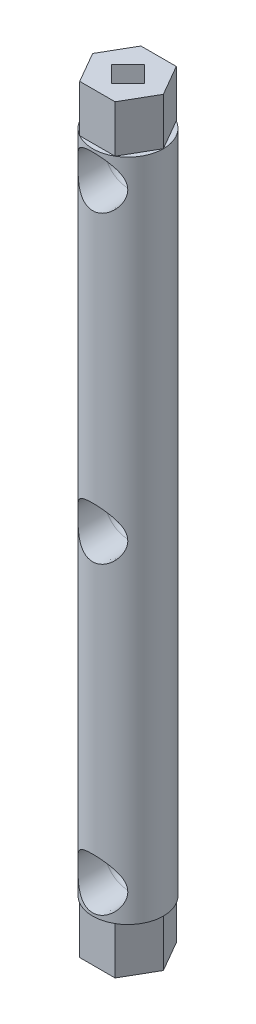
ISO-10303-21;
HEADER;
FILE_DESCRIPTION(('STEP AP214'),'2;1');
FILE_NAME('part.step','',(''),(''),'','','');
FILE_SCHEMA(('AUTOMOTIVE_DESIGN { 1 0 10303 214 1 1 1 1 }'));
ENDSEC;
DATA;
#1=APPLICATION_CONTEXT('core data for automotive mechanical design processes');
#2=APPLICATION_PROTOCOL_DEFINITION('international standard','automotive_design',2000,#1);
#3=PRODUCT_CONTEXT('',#1,'mechanical');
#4=PRODUCT('Part','Part','',(#3));
#5=PRODUCT_RELATED_PRODUCT_CATEGORY('part','',(#4));
#6=PRODUCT_DEFINITION_FORMATION('','',#4);
#7=PRODUCT_DEFINITION_CONTEXT('part definition',#1,'design');
#8=PRODUCT_DEFINITION('design','',#6,#7);
#9=PRODUCT_DEFINITION_SHAPE('','',#8);
#10=(LENGTH_UNIT() NAMED_UNIT(*) SI_UNIT(.MILLI.,.METRE.));
#11=(NAMED_UNIT(*) PLANE_ANGLE_UNIT() SI_UNIT($,.RADIAN.));
#12=(NAMED_UNIT(*) SI_UNIT($,.STERADIAN.) SOLID_ANGLE_UNIT());
#13=UNCERTAINTY_MEASURE_WITH_UNIT(LENGTH_MEASURE(1.E-05),#10,'distance_accuracy_value','');
#14=(GEOMETRIC_REPRESENTATION_CONTEXT(3) GLOBAL_UNCERTAINTY_ASSIGNED_CONTEXT((#13)) GLOBAL_UNIT_ASSIGNED_CONTEXT((#10,
#11,#12)) REPRESENTATION_CONTEXT('',''));
#15=CARTESIAN_POINT('',(0.,0.,0.));
#16=DIRECTION('',(0.,0.,1.));
#17=DIRECTION('',(1.,0.,0.));
#18=AXIS2_PLACEMENT_3D('',#15,#16,#17);
#19=CARTESIAN_POINT('',(0.,0.,0.));
#20=DIRECTION('',(0.,1.,0.));
#21=DIRECTION('',(0.,0.,1.));
#22=AXIS2_PLACEMENT_3D('',#19,#20,#21);
#23=PLANE('',#22);
#24=DIRECTION('',(0.499999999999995,0.,0.866025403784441));
#25=VECTOR('',#24,1.);
#26=CARTESIAN_POINT('',(3.75000000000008,0.,-6.49519052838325));
#27=LINE('',#26,#25);
#28=CARTESIAN_POINT('',(3.75000000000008,0.,-6.49519052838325));
#29=VERTEX_POINT('',#28);
#30=CARTESIAN_POINT('',(7.5,0.,0.));
#31=VERTEX_POINT('',#30);
#32=EDGE_CURVE('E237',#29,#31,#27,.T.);
#33=ORIENTED_EDGE('',*,*,#32,.F.);
#34=CARTESIAN_POINT('',(0.,0.,0.));
#35=DIRECTION('',(0.,1.,0.));
#36=DIRECTION('',(0.,0.,1.));
#37=AXIS2_PLACEMENT_3D('',#34,#35,#36);
#38=CIRCLE('',#37,7.5);
#39=EDGE_CURVE('E359',#31,#29,#38,.T.);
#40=ORIENTED_EDGE('',*,*,#39,.F.);
#41=EDGE_LOOP('',(#33,#40));
#42=FACE_BOUND('',#41,.T.);
#43=ADVANCED_FACE('F33',(#42),#23,.F.);
#44=DIRECTION('',(1.,0.,0.));
#45=VECTOR('',#44,1.);
#46=CARTESIAN_POINT('',(-3.74999999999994,0.,-6.49519052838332));
#47=LINE('',#46,#45);
#48=CARTESIAN_POINT('',(-3.74999999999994,0.,-6.49519052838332));
#49=VERTEX_POINT('',#48);
#50=EDGE_CURVE('E247',#49,#29,#47,.T.);
#51=ORIENTED_EDGE('',*,*,#50,.F.);
#52=EDGE_CURVE('E407',#29,#49,#38,.T.);
#53=ORIENTED_EDGE('',*,*,#52,.F.);
#54=EDGE_LOOP('',(#51,#53));
#55=FACE_BOUND('',#54,.T.);
#56=ADVANCED_FACE('F380',(#55),#23,.F.);
#57=DIRECTION('',(0.500000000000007,0.,-0.866025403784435));
#58=VECTOR('',#57,1.);
#59=CARTESIAN_POINT('',(-7.5,0.,0.));
#60=LINE('',#59,#58);
#61=CARTESIAN_POINT('',(-7.5,0.,0.));
#62=VERTEX_POINT('',#61);
#63=EDGE_CURVE('E269',#62,#49,#60,.T.);
#64=ORIENTED_EDGE('',*,*,#63,.F.);
#65=EDGE_CURVE('E425',#49,#62,#38,.T.);
#66=ORIENTED_EDGE('',*,*,#65,.F.);
#67=EDGE_LOOP('',(#64,#66));
#68=FACE_BOUND('',#67,.T.);
#69=ADVANCED_FACE('F386',(#68),#23,.F.);
#70=DIRECTION('',(-0.499999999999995,0.,-0.866025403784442));
#71=VECTOR('',#70,1.);
#72=CARTESIAN_POINT('',(-3.75000000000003,0.,6.49519052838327));
#73=LINE('',#72,#71);
#74=CARTESIAN_POINT('',(-3.75000000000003,0.,6.49519052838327));
#75=VERTEX_POINT('',#74);
#76=EDGE_CURVE('E266',#75,#62,#73,.T.);
#77=ORIENTED_EDGE('',*,*,#76,.F.);
#78=EDGE_CURVE('E427',#62,#75,#38,.T.);
#79=ORIENTED_EDGE('',*,*,#78,.F.);
#80=EDGE_LOOP('',(#77,#79));
#81=FACE_BOUND('',#80,.T.);
#82=ADVANCED_FACE('F397',(#81),#23,.F.);
#83=DIRECTION('',(-1.,0.,0.));
#84=VECTOR('',#83,1.);
#85=CARTESIAN_POINT('',(3.74999999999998,0.,6.4951905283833));
#86=LINE('',#85,#84);
#87=CARTESIAN_POINT('',(3.74999999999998,0.,6.4951905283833));
#88=VERTEX_POINT('',#87);
#89=EDGE_CURVE('E263',#88,#75,#86,.T.);
#90=ORIENTED_EDGE('',*,*,#89,.F.);
#91=EDGE_CURVE('E349',#75,#88,#38,.T.);
#92=ORIENTED_EDGE('',*,*,#91,.F.);
#93=EDGE_LOOP('',(#90,#92));
#94=FACE_BOUND('',#93,.T.);
#95=ADVANCED_FACE('F389',(#94),#23,.F.);
#96=DIRECTION('',(-0.500000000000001,0.,0.866025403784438));
#97=VECTOR('',#96,1.);
#98=CARTESIAN_POINT('',(7.5,0.,0.));
#99=LINE('',#98,#97);
#100=EDGE_CURVE('E260',#31,#88,#99,.T.);
#101=ORIENTED_EDGE('',*,*,#100,.F.);
#102=EDGE_CURVE('E356',#88,#31,#38,.T.);
#103=ORIENTED_EDGE('',*,*,#102,.F.);
#104=EDGE_LOOP('',(#101,#103));
#105=FACE_BOUND('',#104,.T.);
#106=ADVANCED_FACE('F382',(#105),#23,.F.);
#107=CARTESIAN_POINT('',(0.,141.,0.));
#108=DIRECTION('',(0.,1.,0.));
#109=DIRECTION('',(0.,0.,1.));
#110=AXIS2_PLACEMENT_3D('',#107,#108,#109);
#111=PLANE('',#110);
#112=DIRECTION('',(0.499999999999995,0.,-0.866025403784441));
#113=VECTOR('',#112,1.);
#114=CARTESIAN_POINT('',(3.75000000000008,141.,6.49519052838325));
#115=LINE('',#114,#113);
#116=CARTESIAN_POINT('',(3.75000000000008,141.,6.49519052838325));
#117=VERTEX_POINT('',#116);
#118=CARTESIAN_POINT('',(7.5,141.,0.));
#119=VERTEX_POINT('',#118);
#120=EDGE_CURVE('E291',#117,#119,#115,.T.);
#121=ORIENTED_EDGE('',*,*,#120,.F.);
#122=CARTESIAN_POINT('',(0.,141.,0.));
#123=DIRECTION('',(0.,1.,0.));
#124=DIRECTION('',(0.,0.,1.));
#125=AXIS2_PLACEMENT_3D('',#122,#123,#124);
#126=CIRCLE('',#125,7.5);
#127=EDGE_CURVE('E350',#117,#119,#126,.T.);
#128=ORIENTED_EDGE('',*,*,#127,.T.);
#129=EDGE_LOOP('',(#121,#128));
#130=FACE_BOUND('',#129,.T.);
#131=ADVANCED_FACE('F377',(#130),#111,.T.);
#132=DIRECTION('',(1.,0.,0.));
#133=VECTOR('',#132,1.);
#134=CARTESIAN_POINT('',(-3.74999999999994,141.,6.49519052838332));
#135=LINE('',#134,#133);
#136=CARTESIAN_POINT('',(-3.74999999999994,141.,6.49519052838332));
#137=VERTEX_POINT('',#136);
#138=EDGE_CURVE('E296',#137,#117,#135,.T.);
#139=ORIENTED_EDGE('',*,*,#138,.F.);
#140=EDGE_CURVE('E355',#137,#117,#126,.T.);
#141=ORIENTED_EDGE('',*,*,#140,.T.);
#142=EDGE_LOOP('',(#139,#141));
#143=FACE_BOUND('',#142,.T.);
#144=ADVANCED_FACE('F395',(#143),#111,.T.);
#145=DIRECTION('',(0.500000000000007,0.,0.866025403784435));
#146=VECTOR('',#145,1.);
#147=CARTESIAN_POINT('',(-7.5,141.,0.));
#148=LINE('',#147,#146);
#149=CARTESIAN_POINT('',(-7.5,141.,0.));
#150=VERTEX_POINT('',#149);
#151=EDGE_CURVE('E318',#150,#137,#148,.T.);
#152=ORIENTED_EDGE('',*,*,#151,.F.);
#153=EDGE_CURVE('E543',#150,#137,#126,.T.);
#154=ORIENTED_EDGE('',*,*,#153,.T.);
#155=EDGE_LOOP('',(#152,#154));
#156=FACE_BOUND('',#155,.T.);
#157=ADVANCED_FACE('F542',(#156),#111,.T.);
#158=DIRECTION('',(-0.499999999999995,0.,0.866025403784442));
#159=VECTOR('',#158,1.);
#160=CARTESIAN_POINT('',(-3.75000000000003,141.,-6.49519052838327));
#161=LINE('',#160,#159);
#162=CARTESIAN_POINT('',(-3.75000000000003,141.,-6.49519052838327));
#163=VERTEX_POINT('',#162);
#164=EDGE_CURVE('E315',#163,#150,#161,.T.);
#165=ORIENTED_EDGE('',*,*,#164,.F.);
#166=EDGE_CURVE('E546',#163,#150,#126,.T.);
#167=ORIENTED_EDGE('',*,*,#166,.T.);
#168=EDGE_LOOP('',(#165,#167));
#169=FACE_BOUND('',#168,.T.);
#170=ADVANCED_FACE('F521',(#169),#111,.T.);
#171=DIRECTION('',(-1.,0.,0.));
#172=VECTOR('',#171,1.);
#173=CARTESIAN_POINT('',(3.74999999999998,141.,-6.4951905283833));
#174=LINE('',#173,#172);
#175=CARTESIAN_POINT('',(3.74999999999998,141.,-6.4951905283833));
#176=VERTEX_POINT('',#175);
#177=EDGE_CURVE('E312',#176,#163,#174,.T.);
#178=ORIENTED_EDGE('',*,*,#177,.F.);
#179=EDGE_CURVE('E549',#176,#163,#126,.T.);
#180=ORIENTED_EDGE('',*,*,#179,.T.);
#181=EDGE_LOOP('',(#178,#180));
#182=FACE_BOUND('',#181,.T.);
#183=ADVANCED_FACE('F378',(#182),#111,.T.);
#184=CARTESIAN_POINT('',(0.,141.,0.));
#185=DIRECTION('',(0.,-1.,0.));
#186=DIRECTION('',(0.,0.,-1.));
#187=AXIS2_PLACEMENT_3D('',#184,#185,#186);
#188=CYLINDRICAL_SURFACE('',#187,7.5);
#189=ORIENTED_EDGE('',*,*,#127,.F.);
#190=ORIENTED_EDGE('',*,*,#140,.F.);
#191=ORIENTED_EDGE('',*,*,#153,.F.);
#192=ORIENTED_EDGE('',*,*,#166,.F.);
#193=ORIENTED_EDGE('',*,*,#179,.F.);
#194=EDGE_CURVE('E354',#119,#176,#126,.T.);
#195=ORIENTED_EDGE('',*,*,#194,.F.);
#196=EDGE_LOOP('',(#189,#190,#191,#192,#193,#195));
#197=FACE_BOUND('',#196,.T.);
#198=ORIENTED_EDGE('',*,*,#102,.T.);
#199=ORIENTED_EDGE('',*,*,#39,.T.);
#200=ORIENTED_EDGE('',*,*,#52,.T.);
#201=ORIENTED_EDGE('',*,*,#65,.T.);
#202=ORIENTED_EDGE('',*,*,#78,.T.);
#203=ORIENTED_EDGE('',*,*,#91,.T.);
#204=EDGE_LOOP('',(#198,#199,#200,#201,#202,#203));
#205=FACE_BOUND('',#204,.T.);
#206=CARTESIAN_POINT('',(-4.00594290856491,131.480656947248,6.34053794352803));
#207=CARTESIAN_POINT('',(-3.81657898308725,131.255608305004,6.46017213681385));
#208=CARTESIAN_POINT('',(-3.60832269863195,131.045862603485,6.57982250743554));
#209=CARTESIAN_POINT('',(-3.15591270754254,130.661345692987,6.80842307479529));
#210=CARTESIAN_POINT('',(-2.91170202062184,130.486631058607,6.91735582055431));
#211=CARTESIAN_POINT('',(-2.42980063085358,130.201983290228,7.09942622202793));
#212=CARTESIAN_POINT('',(-2.19670206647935,130.086250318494,7.17548552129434));
#213=CARTESIAN_POINT('',(-1.83251894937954,129.938734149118,7.2737719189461));
#214=CARTESIAN_POINT('',(-1.7087082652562,129.893910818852,7.30389923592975));
#215=CARTESIAN_POINT('',(-1.45689149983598,129.813486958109,7.35826220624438));
#216=CARTESIAN_POINT('',(-1.32888729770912,129.777882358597,7.38250045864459));
#217=CARTESIAN_POINT('',(-1.06865482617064,129.716205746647,7.42465296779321));
#218=CARTESIAN_POINT('',(-0.936404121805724,129.690198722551,7.44252408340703));
#219=CARTESIAN_POINT('',(-0.669527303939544,129.648476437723,7.47126095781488));
#220=CARTESIAN_POINT('',(-0.534901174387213,129.632761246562,7.48212666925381));
#221=CARTESIAN_POINT('',(-0.264470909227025,129.611904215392,7.4965583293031));
#222=CARTESIAN_POINT('',(-0.128667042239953,129.606760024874,7.50012590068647));
#223=CARTESIAN_POINT('',(0.142912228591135,129.607133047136,7.49986733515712));
#224=CARTESIAN_POINT('',(0.27868763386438,129.612649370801,7.4960418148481));
#225=CARTESIAN_POINT('',(0.534897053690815,129.633112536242,7.48188449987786));
#226=CARTESIAN_POINT('',(0.655456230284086,129.647017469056,7.47227174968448));
#227=CARTESIAN_POINT('',(0.894778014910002,129.683104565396,7.44740565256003));
#228=CARTESIAN_POINT('',(1.01354001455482,129.705289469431,7.43215043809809));
#229=CARTESIAN_POINT('',(1.24843464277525,129.757636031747,7.39631781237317));
#230=CARTESIAN_POINT('',(1.36456803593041,129.787795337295,7.37574197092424));
#231=CARTESIAN_POINT('',(1.59360522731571,129.855722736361,7.32967237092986));
#232=CARTESIAN_POINT('',(1.70650775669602,129.893493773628,7.30417670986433));
#233=CARTESIAN_POINT('',(2.04673262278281,130.020324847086,7.21917944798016));
#234=CARTESIAN_POINT('',(2.26796762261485,130.121192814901,7.15236123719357));
#235=CARTESIAN_POINT('',(2.69057048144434,130.349809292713,7.0043650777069));
#236=CARTESIAN_POINT('',(2.89193375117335,130.477563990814,6.92318382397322));
#237=CARTESIAN_POINT('',(3.30341839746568,130.778851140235,6.73766175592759));
#238=CARTESIAN_POINT('',(3.5098352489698,130.956433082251,6.63169122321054));
#239=CARTESIAN_POINT('',(3.89235614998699,131.339693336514,6.41467082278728));
#240=CARTESIAN_POINT('',(4.06840349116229,131.545422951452,6.30361193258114));
#241=CARTESIAN_POINT('',(4.32195085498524,131.89163806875,6.13054855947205));
#242=CARTESIAN_POINT('',(4.41005981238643,132.023838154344,6.06728499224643));
#243=CARTESIAN_POINT('',(4.57485336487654,132.2966109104,5.94401532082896));
#244=CARTESIAN_POINT('',(4.65153497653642,132.437185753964,5.88401006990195));
#245=CARTESIAN_POINT('',(4.86328908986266,132.870506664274,5.71237668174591));
#246=CARTESIAN_POINT('',(4.98070238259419,133.17570511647,5.60867638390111));
#247=CARTESIAN_POINT('',(5.13250982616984,133.712626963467,5.46942063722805));
#248=CARTESIAN_POINT('',(5.18139476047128,133.937339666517,5.42269238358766));
#249=CARTESIAN_POINT('',(5.23355498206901,134.280270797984,5.37219109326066));
#250=CARTESIAN_POINT('',(5.24741238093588,134.395505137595,5.35862421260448));
#251=CARTESIAN_POINT('',(5.26788720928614,134.627247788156,5.33850037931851));
#252=CARTESIAN_POINT('',(5.27450453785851,134.743756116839,5.33194352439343));
#253=CARTESIAN_POINT('',(5.2803806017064,134.977481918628,5.3261238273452));
#254=CARTESIAN_POINT('',(5.27961768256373,135.094700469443,5.32688244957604));
#255=CARTESIAN_POINT('',(5.27069763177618,135.328574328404,5.33570854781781));
#256=CARTESIAN_POINT('',(5.2625405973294,135.445229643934,5.34377592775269));
#257=CARTESIAN_POINT('',(5.23896559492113,135.677220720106,5.3668901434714));
#258=CARTESIAN_POINT('',(5.22354008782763,135.792554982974,5.38194422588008));
#259=CARTESIAN_POINT('',(5.18566707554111,136.021081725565,5.41844494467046));
#260=CARTESIAN_POINT('',(5.16321592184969,136.134273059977,5.43989490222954));
#261=CARTESIAN_POINT('',(5.10592693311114,136.382440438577,5.4937579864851));
#262=CARTESIAN_POINT('',(5.06945163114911,136.516741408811,5.52754424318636));
#263=CARTESIAN_POINT('',(4.98707508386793,136.78052255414,5.60197822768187));
#264=CARTESIAN_POINT('',(4.94116746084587,136.909999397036,5.64263059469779));
#265=CARTESIAN_POINT('',(4.84042597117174,137.163715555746,5.72928348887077));
#266=CARTESIAN_POINT('',(4.78558382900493,137.287949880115,5.77528896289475));
#267=CARTESIAN_POINT('',(4.66747277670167,137.530717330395,5.87115774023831));
#268=CARTESIAN_POINT('',(4.60420532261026,137.649251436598,5.92102037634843));
#269=CARTESIAN_POINT('',(4.39951824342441,138.000791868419,6.07650489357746));
#270=CARTESIAN_POINT('',(4.24524202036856,138.224663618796,6.18619251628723));
#271=CARTESIAN_POINT('',(3.90482732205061,138.646364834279,6.40651846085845));
#272=CARTESIAN_POINT('',(3.71867199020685,138.844180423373,6.5171572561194));
#273=CARTESIAN_POINT('',(3.39757331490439,139.136473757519,6.6876712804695));
#274=CARTESIAN_POINT('',(3.27238997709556,139.240375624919,6.74997120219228));
#275=CARTESIAN_POINT('',(3.01155136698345,139.437053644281,6.87031077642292));
#276=CARTESIAN_POINT('',(2.87589402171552,139.529827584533,6.92834958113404));
#277=CARTESIAN_POINT('',(2.59490010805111,139.703022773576,7.03841137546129));
#278=CARTESIAN_POINT('',(2.44957795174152,139.783461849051,7.09044301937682));
#279=CARTESIAN_POINT('',(2.14992614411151,139.930928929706,7.18697138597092));
#280=CARTESIAN_POINT('',(1.99560067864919,139.99796310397,7.23147157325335));
#281=CARTESIAN_POINT('',(1.72334269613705,140.100710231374,7.30027026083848));
#282=CARTESIAN_POINT('',(1.60727372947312,140.139943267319,7.32674068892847));
#283=CARTESIAN_POINT('',(1.37167989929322,140.210351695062,7.37447814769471));
#284=CARTESIAN_POINT('',(1.25215575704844,140.241528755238,7.39574625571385));
#285=CARTESIAN_POINT('',(1.0104398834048,140.295407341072,7.43262725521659));
#286=CARTESIAN_POINT('',(0.88825007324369,140.31811477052,7.44824408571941));
#287=CARTESIAN_POINT('',(0.641942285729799,140.354765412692,7.47350217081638));
#288=CARTESIAN_POINT('',(0.517824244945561,140.368708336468,7.4831432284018));
#289=CARTESIAN_POINT('',(0.268273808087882,140.387641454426,7.49624427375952));
#290=CARTESIAN_POINT('',(0.142838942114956,140.392609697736,7.4996891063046));
#291=CARTESIAN_POINT('',(-0.108121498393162,140.393449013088,7.50027071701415));
#292=CARTESIAN_POINT('',(-0.233647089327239,140.389316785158,7.49740520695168));
#293=CARTESIAN_POINT('',(-0.483746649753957,140.372014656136,7.48542984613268));
#294=CARTESIAN_POINT('',(-0.608320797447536,140.3588464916,7.47632119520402));
#295=CARTESIAN_POINT('',(-0.855661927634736,140.323668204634,7.45206634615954));
#296=CARTESIAN_POINT('',(-0.978428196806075,140.301654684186,7.43691782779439));
#297=CARTESIAN_POINT('',(-1.21693920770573,140.250035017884,7.40155855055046));
#298=CARTESIAN_POINT('',(-1.33277832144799,140.220727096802,7.38154722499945));
#299=CARTESIAN_POINT('',(-1.56131284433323,140.154538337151,7.33661286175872));
#300=CARTESIAN_POINT('',(-1.67400715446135,140.117654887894,7.31168813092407));
#301=CARTESIAN_POINT('',(-2.0064391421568,139.99625273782,7.23022363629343));
#302=CARTESIAN_POINT('',(-2.22069950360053,139.900943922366,7.16696683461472));
#303=CARTESIAN_POINT('',(-2.65217136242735,139.67392433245,7.01949316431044));
#304=CARTESIAN_POINT('',(-2.86740986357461,139.539473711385,6.93378775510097));
#305=CARTESIAN_POINT('',(-3.27359765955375,139.243849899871,6.75153382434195));
#306=CARTESIAN_POINT('',(-3.46452644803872,139.082654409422,6.65497627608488));
#307=CARTESIAN_POINT('',(-3.85361572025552,138.704647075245,6.43876878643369));
#308=CARTESIAN_POINT('',(-4.04663704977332,138.483059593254,6.31814002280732));
#309=CARTESIAN_POINT('',(-4.30769973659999,138.128401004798,6.14043040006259));
#310=CARTESIAN_POINT('',(-4.39001671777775,138.006388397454,6.08169839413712));
#311=CARTESIAN_POINT('',(-4.54486895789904,137.755147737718,5.96686243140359));
#312=CARTESIAN_POINT('',(-4.61740470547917,137.625920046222,5.91075834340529));
#313=CARTESIAN_POINT('',(-4.79959352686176,137.267281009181,5.76501871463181));
#314=CARTESIAN_POINT('',(-4.89965962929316,137.031095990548,5.67942073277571));
#315=CARTESIAN_POINT('',(-5.02513155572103,136.66371351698,5.56787266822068));
#316=CARTESIAN_POINT('',(-5.0628408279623,136.539120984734,5.53350851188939));
#317=CARTESIAN_POINT('',(-5.12963025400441,136.285998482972,5.47165088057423));
#318=CARTESIAN_POINT('',(-5.1587155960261,136.157470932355,5.44415327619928));
#319=CARTESIAN_POINT('',(-5.20398770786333,135.917402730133,5.40086436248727));
#320=CARTESIAN_POINT('',(-5.22147436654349,135.806313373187,5.38391971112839));
#321=CARTESIAN_POINT('',(-5.24969818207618,135.582536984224,5.35640362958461));
#322=CARTESIAN_POINT('',(-5.26043848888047,135.46985072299,5.34582922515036));
#323=CARTESIAN_POINT('',(-5.27500075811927,135.243663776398,5.33146068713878));
#324=CARTESIAN_POINT('',(-5.27882676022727,135.13016360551,5.32766259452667));
#325=CARTESIAN_POINT('',(-5.27950736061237,134.903119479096,5.32698806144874));
#326=CARTESIAN_POINT('',(-5.27636179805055,134.78957552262,5.33011178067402));
#327=CARTESIAN_POINT('',(-5.26316414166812,134.563499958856,5.34314418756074));
#328=CARTESIAN_POINT('',(-5.25312516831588,134.450966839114,5.35303998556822));
#329=CARTESIAN_POINT('',(-5.22632184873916,134.227438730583,5.37921002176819));
#330=CARTESIAN_POINT('',(-5.20955505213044,134.11644431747,5.39548658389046));
#331=CARTESIAN_POINT('',(-5.14944933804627,133.78647861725,5.45310135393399));
#332=CARTESIAN_POINT('',(-5.09631855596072,133.570744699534,5.50321016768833));
#333=CARTESIAN_POINT('',(-4.9429100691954,133.076151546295,5.64195963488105));
#334=CARTESIAN_POINT('',(-4.83254029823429,132.80257759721,5.73797899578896));
#335=CARTESIAN_POINT('',(-4.57295040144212,132.282207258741,5.94691487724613));
#336=CARTESIAN_POINT('',(-4.4237620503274,132.035389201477,6.05981754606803));
#337=CARTESIAN_POINT('',(-4.21697564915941,131.747625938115,6.20237630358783));
#338=CARTESIAN_POINT('',(-4.17617870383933,131.693078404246,6.22993122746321));
#339=CARTESIAN_POINT('',(-4.09257247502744,131.585633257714,6.28516980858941));
#340=CARTESIAN_POINT('',(-4.04976353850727,131.532735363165,6.3128534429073));
#341=CARTESIAN_POINT('',(-4.00594290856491,131.480656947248,6.34053794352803));
#342=B_SPLINE_CURVE_WITH_KNOTS('',3,(#206,#207,#208,#209,#210,#211,#212,#213,#214,#215,#216,
#217,#218,#219,#220,#221,#222,#223,#224,#225,#226,#227,#228,#229,#230,#231,#232,#233,#234,#235,
#236,#237,#238,#239,#240,#241,#242,#243,#244,#245,#246,#247,#248,#249,#250,#251,#252,#253,#254,
#255,#256,#257,#258,#259,#260,#261,#262,#263,#264,#265,#266,#267,#268,#269,#270,#271,#272,#273,
#274,#275,#276,#277,#278,#279,#280,#281,#282,#283,#284,#285,#286,#287,#288,#289,#290,#291,#292,
#293,#294,#295,#296,#297,#298,#299,#300,#301,#302,#303,#304,#305,#306,#307,#308,#309,#310,#311,
#312,#313,#314,#315,#316,#317,#318,#319,#320,#321,#322,#323,#324,#325,#326,#327,#328,#329,#330,
#331,#332,#333,#334,#335,#336,#337,#338,#339,#340,#341),.UNSPECIFIED.,.T.,.F.,(4,2,2,2,2,2,2,2,
2,2,2,2,2,2,2,2,2,2,2,2,2,2,2,2,2,2,2,2,2,2,2,2,2,2,2,2,2,2,2,2,2,2,2,2,2,2,2,2,2,2,2,2,2,2,2,2,
2,2,2,2,2,2,2,2,2,2,2,4),(0.,0.952308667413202,1.90614312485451,2.71582934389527,
3.1206339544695,3.52525958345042,3.93257686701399,4.33989690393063,4.74712636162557,
5.15432185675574,5.51911241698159,5.88402382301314,6.24882768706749,6.61377290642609,
7.36705901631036,8.12051868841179,8.99386563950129,9.86882612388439,10.3812597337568,
10.8938268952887,11.9155344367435,12.6165078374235,12.9666802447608,13.3168575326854,
13.6680625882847,14.0192630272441,14.3708285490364,14.7225769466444,15.1515748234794,
15.5808637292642,16.010552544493,16.4401671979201,17.3165134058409,18.1933244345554,
18.7153201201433,19.2374193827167,19.7587568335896,20.2798538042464,20.6555193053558,
21.0311069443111,21.4064322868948,21.7817700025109,22.1580245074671,22.5344154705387,
22.9107341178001,23.2871974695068,23.6502575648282,24.0134429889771,24.7392802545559,
25.5399470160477,26.3412847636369,27.2901411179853,27.7651416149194,28.2401183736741,
29.0477747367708,29.4512802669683,29.8545425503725,30.19536293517,30.5360240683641,
30.8764861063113,31.2169559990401,31.5567796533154,31.8967271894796,32.5772765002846,
33.5032016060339,34.4283711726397,34.6487824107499,34.8691557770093),.UNSPECIFIED.);
#343=CARTESIAN_POINT('',(-4.00594290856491,131.480656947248,6.34053794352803));
#344=VERTEX_POINT('',#343);
#345=EDGE_CURVE('E353',#344,#344,#342,.T.);
#346=ORIENTED_EDGE('',*,*,#345,.F.);
#347=EDGE_LOOP('',(#346));
#348=FACE_BOUND('',#347,.T.);
#349=CARTESIAN_POINT('',(-4.00594290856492,66.9806569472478,6.34053794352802));
#350=CARTESIAN_POINT('',(-3.81657898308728,66.7556083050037,6.46017213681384));
#351=CARTESIAN_POINT('',(-3.60832269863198,66.5458626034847,6.57982250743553));
#352=CARTESIAN_POINT('',(-3.15591270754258,66.1613456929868,6.80842307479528));
#353=CARTESIAN_POINT('',(-2.91170202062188,65.9866310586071,6.9173558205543));
#354=CARTESIAN_POINT('',(-2.42980063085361,65.7019832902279,7.09942622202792));
#355=CARTESIAN_POINT('',(-2.19670206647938,65.5862503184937,7.17548552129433));
#356=CARTESIAN_POINT('',(-1.83251894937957,65.4387341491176,7.2737719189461));
#357=CARTESIAN_POINT('',(-1.70870826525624,65.3939108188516,7.30389923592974));
#358=CARTESIAN_POINT('',(-1.45689149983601,65.3134869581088,7.35826220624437));
#359=CARTESIAN_POINT('',(-1.32888729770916,65.2778823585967,7.38250045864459));
#360=CARTESIAN_POINT('',(-1.06865482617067,65.2162057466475,7.42465296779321));
#361=CARTESIAN_POINT('',(-0.936404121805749,65.1901987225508,7.44252408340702));
#362=CARTESIAN_POINT('',(-0.669527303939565,65.1484764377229,7.47126095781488));
#363=CARTESIAN_POINT('',(-0.534901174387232,65.1327612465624,7.48212666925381));
#364=CARTESIAN_POINT('',(-0.264470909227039,65.1119042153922,7.4965583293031));
#365=CARTESIAN_POINT('',(-0.128667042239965,65.1067600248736,7.50012590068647));
#366=CARTESIAN_POINT('',(0.142912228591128,65.107133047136,7.49986733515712));
#367=CARTESIAN_POINT('',(0.278687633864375,65.1126493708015,7.49604181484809));
#368=CARTESIAN_POINT('',(0.534897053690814,65.133112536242,7.48188449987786));
#369=CARTESIAN_POINT('',(0.655456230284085,65.1470174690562,7.47227174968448));
#370=CARTESIAN_POINT('',(0.894778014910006,65.183104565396,7.44740565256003));
#371=CARTESIAN_POINT('',(1.01354001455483,65.205289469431,7.43215043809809));
#372=CARTESIAN_POINT('',(1.24843464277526,65.2576360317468,7.39631781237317));
#373=CARTESIAN_POINT('',(1.36456803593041,65.2877953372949,7.37574197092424));
#374=CARTESIAN_POINT('',(1.5936052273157,65.3557227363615,7.32967237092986));
#375=CARTESIAN_POINT('',(1.70650775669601,65.393493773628,7.30417670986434));
#376=CARTESIAN_POINT('',(2.0467326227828,65.5203248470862,7.21917944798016));
#377=CARTESIAN_POINT('',(2.26796762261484,65.6211928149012,7.15236123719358));
#378=CARTESIAN_POINT('',(2.69057048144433,65.849809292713,7.0043650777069));
#379=CARTESIAN_POINT('',(2.89193375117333,65.9775639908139,6.92318382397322));
#380=CARTESIAN_POINT('',(3.30341839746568,66.2788511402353,6.73766175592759));
#381=CARTESIAN_POINT('',(3.5098352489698,66.4564330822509,6.63169122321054));
#382=CARTESIAN_POINT('',(3.892356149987,66.8396933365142,6.41467082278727));
#383=CARTESIAN_POINT('',(4.0684034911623,67.0454229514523,6.30361193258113));
#384=CARTESIAN_POINT('',(4.32195085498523,67.3916380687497,6.13054855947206));
#385=CARTESIAN_POINT('',(4.41005981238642,67.5238381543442,6.06728499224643));
#386=CARTESIAN_POINT('',(4.57485336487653,67.7966109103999,5.94401532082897));
#387=CARTESIAN_POINT('',(4.65153497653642,67.9371857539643,5.88401006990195));
#388=CARTESIAN_POINT('',(4.86328908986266,68.3705066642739,5.71237668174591));
#389=CARTESIAN_POINT('',(4.98070238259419,68.6757051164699,5.60867638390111));
#390=CARTESIAN_POINT('',(5.13250982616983,69.2126269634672,5.46942063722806));
#391=CARTESIAN_POINT('',(5.18139476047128,69.4373396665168,5.42269238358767));
#392=CARTESIAN_POINT('',(5.233554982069,69.7802707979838,5.37219109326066));
#393=CARTESIAN_POINT('',(5.24741238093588,69.8955051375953,5.35862421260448));
#394=CARTESIAN_POINT('',(5.26788720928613,70.1272477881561,5.33850037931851));
#395=CARTESIAN_POINT('',(5.27450453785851,70.2437561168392,5.33194352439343));
#396=CARTESIAN_POINT('',(5.2803806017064,70.4774819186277,5.3261238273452));
#397=CARTESIAN_POINT('',(5.27961768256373,70.5947004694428,5.32688244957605));
#398=CARTESIAN_POINT('',(5.27069763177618,70.8285743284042,5.33570854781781));
#399=CARTESIAN_POINT('',(5.2625405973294,70.9452296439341,5.34377592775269));
#400=CARTESIAN_POINT('',(5.23896559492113,71.1772207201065,5.3668901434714));
#401=CARTESIAN_POINT('',(5.22354008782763,71.2925549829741,5.38194422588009));
#402=CARTESIAN_POINT('',(5.1856670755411,71.5210817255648,5.41844494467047));
#403=CARTESIAN_POINT('',(5.16321592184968,71.634273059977,5.43989490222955));
#404=CARTESIAN_POINT('',(5.10592693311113,71.8824404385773,5.49375798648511));
#405=CARTESIAN_POINT('',(5.0694516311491,72.0167414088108,5.52754424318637));
#406=CARTESIAN_POINT('',(4.98707508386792,72.2805225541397,5.60197822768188));
#407=CARTESIAN_POINT('',(4.94116746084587,72.4099993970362,5.64263059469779));
#408=CARTESIAN_POINT('',(4.84042597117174,72.6637155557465,5.72928348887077));
#409=CARTESIAN_POINT('',(4.78558382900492,72.7879498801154,5.77528896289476));
#410=CARTESIAN_POINT('',(4.66747277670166,73.0307173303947,5.87115774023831));
#411=CARTESIAN_POINT('',(4.60420532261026,73.1492514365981,5.92102037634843));
#412=CARTESIAN_POINT('',(4.39951824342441,73.5007918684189,6.07650489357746));
#413=CARTESIAN_POINT('',(4.24524202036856,73.7246636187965,6.18619251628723));
#414=CARTESIAN_POINT('',(3.9048273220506,74.1463648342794,6.40651846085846));
#415=CARTESIAN_POINT('',(3.71867199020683,74.3441804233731,6.51715725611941));
#416=CARTESIAN_POINT('',(3.39757331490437,74.6364737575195,6.68767128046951));
#417=CARTESIAN_POINT('',(3.27238997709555,74.7403756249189,6.74997120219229));
#418=CARTESIAN_POINT('',(3.01155136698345,74.9370536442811,6.87031077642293));
#419=CARTESIAN_POINT('',(2.87589402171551,75.0298275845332,6.92834958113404));
#420=CARTESIAN_POINT('',(2.5949001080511,75.2030227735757,7.03841137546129));
#421=CARTESIAN_POINT('',(2.44957795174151,75.2834618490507,7.09044301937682));
#422=CARTESIAN_POINT('',(2.1499261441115,75.4309289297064,7.18697138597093));
#423=CARTESIAN_POINT('',(1.99560067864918,75.4979631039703,7.23147157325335));
#424=CARTESIAN_POINT('',(1.72334269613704,75.6007102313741,7.30027026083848));
#425=CARTESIAN_POINT('',(1.60727372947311,75.6399432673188,7.32674068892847));
#426=CARTESIAN_POINT('',(1.37167989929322,75.7103516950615,7.37447814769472));
#427=CARTESIAN_POINT('',(1.25215575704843,75.7415287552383,7.39574625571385));
#428=CARTESIAN_POINT('',(1.01043988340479,75.7954073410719,7.43262725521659));
#429=CARTESIAN_POINT('',(0.888250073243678,75.8181147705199,7.44824408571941));
#430=CARTESIAN_POINT('',(0.641942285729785,75.8547654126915,7.47350217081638));
#431=CARTESIAN_POINT('',(0.517824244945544,75.868708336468,7.4831432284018));
#432=CARTESIAN_POINT('',(0.268273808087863,75.8876414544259,7.49624427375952));
#433=CARTESIAN_POINT('',(0.142838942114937,75.8926096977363,7.4996891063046));
#434=CARTESIAN_POINT('',(-0.108121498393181,75.8934490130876,7.50027071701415));
#435=CARTESIAN_POINT('',(-0.233647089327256,75.8893167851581,7.49740520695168));
#436=CARTESIAN_POINT('',(-0.483746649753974,75.8720146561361,7.48542984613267));
#437=CARTESIAN_POINT('',(-0.608320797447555,75.8588464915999,7.47632119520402));
#438=CARTESIAN_POINT('',(-0.855661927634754,75.8236682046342,7.45206634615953));
#439=CARTESIAN_POINT('',(-0.97842819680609,75.8016546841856,7.43691782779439));
#440=CARTESIAN_POINT('',(-1.21693920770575,75.7500350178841,7.40155855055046));
#441=CARTESIAN_POINT('',(-1.33277832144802,75.7207270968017,7.38154722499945));
#442=CARTESIAN_POINT('',(-1.56131284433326,75.6545383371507,7.33661286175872));
#443=CARTESIAN_POINT('',(-1.67400715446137,75.6176548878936,7.31168813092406));
#444=CARTESIAN_POINT('',(-2.00643914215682,75.4962527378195,7.23022363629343));
#445=CARTESIAN_POINT('',(-2.22069950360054,75.400943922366,7.16696683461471));
#446=CARTESIAN_POINT('',(-2.65217136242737,75.17392433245,7.01949316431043));
#447=CARTESIAN_POINT('',(-2.86740986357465,75.0394737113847,6.93378775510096));
#448=CARTESIAN_POINT('',(-3.27359765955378,74.7438498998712,6.75153382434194));
#449=CARTESIAN_POINT('',(-3.46452644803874,74.5826544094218,6.65497627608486));
#450=CARTESIAN_POINT('',(-3.85361572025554,74.2046470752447,6.43876878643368));
#451=CARTESIAN_POINT('',(-4.04663704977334,73.9830595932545,6.31814002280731));
#452=CARTESIAN_POINT('',(-4.3076997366,73.628401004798,6.14043040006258));
#453=CARTESIAN_POINT('',(-4.39001671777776,73.5063883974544,6.08169839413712));
#454=CARTESIAN_POINT('',(-4.54486895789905,73.2551477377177,5.96686243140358));
#455=CARTESIAN_POINT('',(-4.61740470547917,73.1259200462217,5.91075834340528));
#456=CARTESIAN_POINT('',(-4.79959352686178,72.7672810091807,5.7650187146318));
#457=CARTESIAN_POINT('',(-4.89965962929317,72.5310959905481,5.6794207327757));
#458=CARTESIAN_POINT('',(-5.02513155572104,72.1637135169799,5.56787266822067));
#459=CARTESIAN_POINT('',(-5.0628408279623,72.0391209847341,5.53350851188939));
#460=CARTESIAN_POINT('',(-5.12963025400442,71.7859984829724,5.47165088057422));
#461=CARTESIAN_POINT('',(-5.15871559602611,71.657470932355,5.44415327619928));
#462=CARTESIAN_POINT('',(-5.20398770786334,71.4174027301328,5.40086436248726));
#463=CARTESIAN_POINT('',(-5.2214743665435,71.3063133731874,5.38391971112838));
#464=CARTESIAN_POINT('',(-5.24969818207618,71.0825369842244,5.35640362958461));
#465=CARTESIAN_POINT('',(-5.26043848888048,70.9698507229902,5.34582922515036));
#466=CARTESIAN_POINT('',(-5.27500075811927,70.7436637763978,5.33146068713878));
#467=CARTESIAN_POINT('',(-5.27882676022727,70.6301636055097,5.32766259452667));
#468=CARTESIAN_POINT('',(-5.27950736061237,70.4031194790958,5.32698806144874));
#469=CARTESIAN_POINT('',(-5.27636179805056,70.2895755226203,5.33011178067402));
#470=CARTESIAN_POINT('',(-5.26316414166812,70.0634999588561,5.34314418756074));
#471=CARTESIAN_POINT('',(-5.25312516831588,69.9509668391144,5.35303998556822));
#472=CARTESIAN_POINT('',(-5.22632184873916,69.7274387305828,5.37921002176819));
#473=CARTESIAN_POINT('',(-5.20955505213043,69.6164443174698,5.39548658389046));
#474=CARTESIAN_POINT('',(-5.14944933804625,69.2864786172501,5.453101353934));
#475=CARTESIAN_POINT('',(-5.09631855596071,69.0707446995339,5.50321016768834));
#476=CARTESIAN_POINT('',(-4.94291006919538,68.5761515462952,5.64195963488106));
#477=CARTESIAN_POINT('',(-4.83254029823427,68.3025775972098,5.73797899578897));
#478=CARTESIAN_POINT('',(-4.57295040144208,67.7822072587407,5.94691487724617));
#479=CARTESIAN_POINT('',(-4.42376205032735,67.5353892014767,6.05981754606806));
#480=CARTESIAN_POINT('',(-4.21697564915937,67.2476259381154,6.20237630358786));
#481=CARTESIAN_POINT('',(-4.17617870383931,67.1930784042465,6.22993122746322));
#482=CARTESIAN_POINT('',(-4.09257247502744,67.0856332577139,6.28516980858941));
#483=CARTESIAN_POINT('',(-4.04976353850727,67.0327353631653,6.3128534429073));
#484=CARTESIAN_POINT('',(-4.00594290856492,66.9806569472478,6.34053794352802));
#485=B_SPLINE_CURVE_WITH_KNOTS('',3,(#349,#350,#351,#352,#353,#354,#355,#356,#357,#358,#359,
#360,#361,#362,#363,#364,#365,#366,#367,#368,#369,#370,#371,#372,#373,#374,#375,#376,#377,#378,
#379,#380,#381,#382,#383,#384,#385,#386,#387,#388,#389,#390,#391,#392,#393,#394,#395,#396,#397,
#398,#399,#400,#401,#402,#403,#404,#405,#406,#407,#408,#409,#410,#411,#412,#413,#414,#415,#416,
#417,#418,#419,#420,#421,#422,#423,#424,#425,#426,#427,#428,#429,#430,#431,#432,#433,#434,#435,
#436,#437,#438,#439,#440,#441,#442,#443,#444,#445,#446,#447,#448,#449,#450,#451,#452,#453,#454,
#455,#456,#457,#458,#459,#460,#461,#462,#463,#464,#465,#466,#467,#468,#469,#470,#471,#472,#473,
#474,#475,#476,#477,#478,#479,#480,#481,#482,#483,#484),.UNSPECIFIED.,.T.,.F.,(4,2,2,2,2,2,2,2,
2,2,2,2,2,2,2,2,2,2,2,2,2,2,2,2,2,2,2,2,2,2,2,2,2,2,2,2,2,2,2,2,2,2,2,2,2,2,2,2,2,2,2,2,2,2,2,2,
2,2,2,2,2,2,2,2,2,2,2,4),(0.,0.952308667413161,1.90614312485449,2.71582934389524,
3.12063395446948,3.52525958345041,3.93257686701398,4.33989690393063,4.74712636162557,
5.15432185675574,5.5191124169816,5.88402382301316,6.2488276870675,6.6137729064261,
7.36705901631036,8.12051868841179,8.99386563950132,9.86882612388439,10.3812597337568,
10.8938268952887,11.9155344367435,12.6165078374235,12.9666802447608,13.3168575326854,
13.6680625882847,14.0192630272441,14.3708285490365,14.7225769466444,15.1515748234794,
15.5808637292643,16.010552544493,16.4401671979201,17.3165134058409,18.1933244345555,
18.7153201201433,19.2374193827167,19.7587568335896,20.2798538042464,20.6555193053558,
21.0311069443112,21.4064322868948,21.7817700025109,22.1580245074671,22.5344154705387,
22.9107341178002,23.2871974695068,23.6502575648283,24.0134429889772,24.739280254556,
25.5399470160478,26.3412847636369,27.2901411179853,27.7651416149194,28.2401183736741,
29.0477747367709,29.4512802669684,29.8545425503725,30.1953629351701,30.5360240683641,
30.8764861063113,31.2169559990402,31.5567796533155,31.8967271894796,32.5772765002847,
33.503201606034,34.4283711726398,34.6487824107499,34.8691557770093),.UNSPECIFIED.);
#486=CARTESIAN_POINT('',(-4.00594290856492,66.9806569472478,6.34053794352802));
#487=VERTEX_POINT('',#486);
#488=EDGE_CURVE('E45',#487,#487,#485,.T.);
#489=ORIENTED_EDGE('',*,*,#488,.F.);
#490=EDGE_LOOP('',(#489));
#491=FACE_BOUND('',#490,.T.);
#492=CARTESIAN_POINT('',(-4.00594290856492,2.48065694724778,6.34053794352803));
#493=CARTESIAN_POINT('',(-3.81657898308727,2.2556083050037,6.46017213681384));
#494=CARTESIAN_POINT('',(-3.60832269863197,2.04586260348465,6.57982250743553));
#495=CARTESIAN_POINT('',(-3.15591270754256,1.66134569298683,6.80842307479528));
#496=CARTESIAN_POINT('',(-2.91170202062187,1.4866310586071,6.9173558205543));
#497=CARTESIAN_POINT('',(-2.4298006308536,1.20198329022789,7.09942622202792));
#498=CARTESIAN_POINT('',(-2.19670206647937,1.08625031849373,7.17548552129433));
#499=CARTESIAN_POINT('',(-1.83251894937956,0.938734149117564,7.2737719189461));
#500=CARTESIAN_POINT('',(-1.70870826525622,0.893910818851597,7.30389923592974));
#501=CARTESIAN_POINT('',(-1.456891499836,0.813486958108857,7.35826220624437));
#502=CARTESIAN_POINT('',(-1.32888729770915,0.777882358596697,7.38250045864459));
#503=CARTESIAN_POINT('',(-1.06865482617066,0.716205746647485,7.42465296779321));
#504=CARTESIAN_POINT('',(-0.936404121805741,0.690198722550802,7.44252408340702));
#505=CARTESIAN_POINT('',(-0.669527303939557,0.648476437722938,7.47126095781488));
#506=CARTESIAN_POINT('',(-0.534901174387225,0.632761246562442,7.48212666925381));
#507=CARTESIAN_POINT('',(-0.264470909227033,0.611904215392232,7.4965583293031));
#508=CARTESIAN_POINT('',(-0.128667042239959,0.606760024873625,7.50012590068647));
#509=CARTESIAN_POINT('',(0.142912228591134,0.607133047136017,7.49986733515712));
#510=CARTESIAN_POINT('',(0.278687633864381,0.612649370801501,7.4960418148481));
#511=CARTESIAN_POINT('',(0.534897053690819,0.633112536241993,7.48188449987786));
#512=CARTESIAN_POINT('',(0.655456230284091,0.647017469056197,7.47227174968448));
#513=CARTESIAN_POINT('',(0.89477801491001,0.683104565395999,7.44740565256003));
#514=CARTESIAN_POINT('',(1.01354001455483,0.70528946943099,7.43215043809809));
#515=CARTESIAN_POINT('',(1.24843464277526,0.757636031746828,7.39631781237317));
#516=CARTESIAN_POINT('',(1.36456803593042,0.787795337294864,7.37574197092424));
#517=CARTESIAN_POINT('',(1.59360522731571,0.855722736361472,7.32967237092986));
#518=CARTESIAN_POINT('',(1.70650775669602,0.893493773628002,7.30417670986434));
#519=CARTESIAN_POINT('',(2.04673262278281,1.02032484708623,7.21917944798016));
#520=CARTESIAN_POINT('',(2.26796762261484,1.12119281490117,7.15236123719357));
#521=CARTESIAN_POINT('',(2.69057048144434,1.34980929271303,7.0043650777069));
#522=CARTESIAN_POINT('',(2.89193375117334,1.47756399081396,6.92318382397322));
#523=CARTESIAN_POINT('',(3.30341839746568,1.77885114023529,6.73766175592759));
#524=CARTESIAN_POINT('',(3.5098352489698,1.95643308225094,6.63169122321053));
#525=CARTESIAN_POINT('',(3.892356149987,2.33969333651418,6.41467082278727));
#526=CARTESIAN_POINT('',(4.0684034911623,2.54542295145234,6.30361193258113));
#527=CARTESIAN_POINT('',(4.32195085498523,2.89163806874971,6.13054855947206));
#528=CARTESIAN_POINT('',(4.41005981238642,3.02383815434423,6.06728499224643));
#529=CARTESIAN_POINT('',(4.57485336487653,3.29661091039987,5.94401532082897));
#530=CARTESIAN_POINT('',(4.65153497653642,3.43718575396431,5.88401006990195));
#531=CARTESIAN_POINT('',(4.86328908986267,3.87050666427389,5.7123766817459));
#532=CARTESIAN_POINT('',(4.98070238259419,4.17570511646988,5.6086763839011));
#533=CARTESIAN_POINT('',(5.13250982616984,4.71262696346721,5.46942063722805));
#534=CARTESIAN_POINT('',(5.18139476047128,4.93733966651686,5.42269238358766));
#535=CARTESIAN_POINT('',(5.233554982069,5.28027079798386,5.37219109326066));
#536=CARTESIAN_POINT('',(5.24741238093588,5.39550513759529,5.35862421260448));
#537=CARTESIAN_POINT('',(5.26788720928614,5.62724778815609,5.33850037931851));
#538=CARTESIAN_POINT('',(5.27450453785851,5.74375611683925,5.33194352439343));
#539=CARTESIAN_POINT('',(5.2803806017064,5.97748191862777,5.3261238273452));
#540=CARTESIAN_POINT('',(5.27961768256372,6.09470046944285,5.32688244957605));
#541=CARTESIAN_POINT('',(5.27069763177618,6.32857432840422,5.33570854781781));
#542=CARTESIAN_POINT('',(5.2625405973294,6.44522964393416,5.34377592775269));
#543=CARTESIAN_POINT('',(5.23896559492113,6.67722072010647,5.3668901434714));
#544=CARTESIAN_POINT('',(5.22354008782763,6.79255498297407,5.38194422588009));
#545=CARTESIAN_POINT('',(5.1856670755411,7.02108172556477,5.41844494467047));
#546=CARTESIAN_POINT('',(5.16321592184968,7.13427305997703,5.43989490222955));
#547=CARTESIAN_POINT('',(5.10592693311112,7.3824404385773,5.49375798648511));
#548=CARTESIAN_POINT('',(5.06945163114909,7.51674140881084,5.52754424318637));
#549=CARTESIAN_POINT('',(4.98707508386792,7.78052255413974,5.60197822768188));
#550=CARTESIAN_POINT('',(4.94116746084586,7.90999939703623,5.6426305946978));
#551=CARTESIAN_POINT('',(4.84042597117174,8.16371555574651,5.72928348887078));
#552=CARTESIAN_POINT('',(4.78558382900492,8.28794988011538,5.77528896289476));
#553=CARTESIAN_POINT('',(4.66747277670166,8.53071733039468,5.87115774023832));
#554=CARTESIAN_POINT('',(4.60420532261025,8.64925143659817,5.92102037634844));
#555=CARTESIAN_POINT('',(4.3995182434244,9.00079186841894,6.07650489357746));
#556=CARTESIAN_POINT('',(4.24524202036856,9.22466361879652,6.18619251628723));
#557=CARTESIAN_POINT('',(3.90482732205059,9.64636483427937,6.40651846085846));
#558=CARTESIAN_POINT('',(3.71867199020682,9.84418042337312,6.51715725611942));
#559=CARTESIAN_POINT('',(3.39757331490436,10.1364737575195,6.68767128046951));
#560=CARTESIAN_POINT('',(3.27238997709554,10.2403756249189,6.74997120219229));
#561=CARTESIAN_POINT('',(3.01155136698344,10.4370536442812,6.87031077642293));
#562=CARTESIAN_POINT('',(2.8758940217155,10.5298275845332,6.92834958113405));
#563=CARTESIAN_POINT('',(2.59490010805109,10.7030227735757,7.03841137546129));
#564=CARTESIAN_POINT('',(2.44957795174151,10.7834618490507,7.09044301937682));
#565=CARTESIAN_POINT('',(2.1499261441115,10.9309289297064,7.18697138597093));
#566=CARTESIAN_POINT('',(1.99560067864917,10.9979631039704,7.23147157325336));
#567=CARTESIAN_POINT('',(1.72334269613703,11.1007102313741,7.30027026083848));
#568=CARTESIAN_POINT('',(1.6072737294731,11.1399432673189,7.32674068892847));
#569=CARTESIAN_POINT('',(1.37167989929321,11.2103516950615,7.37447814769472));
#570=CARTESIAN_POINT('',(1.25215575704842,11.2415287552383,7.39574625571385));
#571=CARTESIAN_POINT('',(1.01043988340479,11.2954073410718,7.43262725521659));
#572=CARTESIAN_POINT('',(0.888250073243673,11.3181147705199,7.44824408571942));
#573=CARTESIAN_POINT('',(0.641942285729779,11.3547654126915,7.47350217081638));
#574=CARTESIAN_POINT('',(0.517824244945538,11.368708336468,7.4831432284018));
#575=CARTESIAN_POINT('',(0.268273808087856,11.3876414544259,7.49624427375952));
#576=CARTESIAN_POINT('',(0.14283894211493,11.3926096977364,7.4996891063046));
#577=CARTESIAN_POINT('',(-0.108121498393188,11.3934490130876,7.50027071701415));
#578=CARTESIAN_POINT('',(-0.233647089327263,11.3893167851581,7.49740520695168));
#579=CARTESIAN_POINT('',(-0.483746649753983,11.3720146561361,7.48542984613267));
#580=CARTESIAN_POINT('',(-0.608320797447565,11.3588464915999,7.47632119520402));
#581=CARTESIAN_POINT('',(-0.855661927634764,11.3236682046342,7.45206634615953));
#582=CARTESIAN_POINT('',(-0.978428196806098,11.3016546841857,7.43691782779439));
#583=CARTESIAN_POINT('',(-1.21693920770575,11.2500350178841,7.40155855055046));
#584=CARTESIAN_POINT('',(-1.33277832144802,11.2207270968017,7.38154722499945));
#585=CARTESIAN_POINT('',(-1.56131284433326,11.1545383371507,7.33661286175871));
#586=CARTESIAN_POINT('',(-1.67400715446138,11.1176548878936,7.31168813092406));
#587=CARTESIAN_POINT('',(-2.00643914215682,10.9962527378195,7.23022363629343));
#588=CARTESIAN_POINT('',(-2.22069950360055,10.900943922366,7.16696683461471));
#589=CARTESIAN_POINT('',(-2.65217136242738,10.67392433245,7.01949316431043));
#590=CARTESIAN_POINT('',(-2.86740986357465,10.5394737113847,6.93378775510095));
#591=CARTESIAN_POINT('',(-3.27359765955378,10.2438498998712,6.75153382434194));
#592=CARTESIAN_POINT('',(-3.46452644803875,10.0826544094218,6.65497627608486));
#593=CARTESIAN_POINT('',(-3.85361572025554,9.70464707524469,6.43876878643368));
#594=CARTESIAN_POINT('',(-4.04663704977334,9.48305959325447,6.3181400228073));
#595=CARTESIAN_POINT('',(-4.30769973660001,9.12840100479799,6.14043040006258));
#596=CARTESIAN_POINT('',(-4.39001671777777,9.00638839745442,6.08169839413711));
#597=CARTESIAN_POINT('',(-4.54486895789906,8.75514773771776,5.96686243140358));
#598=CARTESIAN_POINT('',(-4.61740470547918,8.6259200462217,5.91075834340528));
#599=CARTESIAN_POINT('',(-4.79959352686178,8.26728100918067,5.7650187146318));
#600=CARTESIAN_POINT('',(-4.89965962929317,8.0310959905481,5.6794207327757));
#601=CARTESIAN_POINT('',(-5.02513155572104,7.6637135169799,5.56787266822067));
#602=CARTESIAN_POINT('',(-5.06284082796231,7.53912098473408,5.53350851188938));
#603=CARTESIAN_POINT('',(-5.12963025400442,7.28599848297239,5.47165088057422));
#604=CARTESIAN_POINT('',(-5.15871559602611,7.157470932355,5.44415327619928));
#605=CARTESIAN_POINT('',(-5.20398770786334,6.91740273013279,5.40086436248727));
#606=CARTESIAN_POINT('',(-5.2214743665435,6.80631337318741,5.38391971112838));
#607=CARTESIAN_POINT('',(-5.24969818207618,6.58253698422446,5.35640362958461));
#608=CARTESIAN_POINT('',(-5.26043848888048,6.46985072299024,5.34582922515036));
#609=CARTESIAN_POINT('',(-5.27500075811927,6.24366377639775,5.33146068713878));
#610=CARTESIAN_POINT('',(-5.27882676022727,6.13016360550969,5.32766259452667));
#611=CARTESIAN_POINT('',(-5.27950736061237,5.90311947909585,5.32698806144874));
#612=CARTESIAN_POINT('',(-5.27636179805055,5.78957552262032,5.33011178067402));
#613=CARTESIAN_POINT('',(-5.26316414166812,5.56349995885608,5.34314418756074));
#614=CARTESIAN_POINT('',(-5.25312516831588,5.45096683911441,5.35303998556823));
#615=CARTESIAN_POINT('',(-5.22632184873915,5.22743873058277,5.37921002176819));
#616=CARTESIAN_POINT('',(-5.20955505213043,5.11644431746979,5.39548658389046));
#617=CARTESIAN_POINT('',(-5.14944933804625,4.78647861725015,5.453101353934));
#618=CARTESIAN_POINT('',(-5.09631855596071,4.57074469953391,5.50321016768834));
#619=CARTESIAN_POINT('',(-4.94291006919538,4.0761515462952,5.64195963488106));
#620=CARTESIAN_POINT('',(-4.83254029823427,3.80257759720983,5.73797899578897));
#621=CARTESIAN_POINT('',(-4.57295040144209,3.28220725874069,5.94691487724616));
#622=CARTESIAN_POINT('',(-4.42376205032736,3.03538920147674,6.05981754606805));
#623=CARTESIAN_POINT('',(-4.21697564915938,2.74762593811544,6.20237630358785));
#624=CARTESIAN_POINT('',(-4.17617870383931,2.69307840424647,6.22993122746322));
#625=CARTESIAN_POINT('',(-4.09257247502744,2.58563325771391,6.28516980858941));
#626=CARTESIAN_POINT('',(-4.04976353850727,2.53273536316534,6.3128534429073));
#627=CARTESIAN_POINT('',(-4.00594290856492,2.48065694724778,6.34053794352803));
#628=B_SPLINE_CURVE_WITH_KNOTS('',3,(#492,#493,#494,#495,#496,#497,#498,#499,#500,#501,#502,
#503,#504,#505,#506,#507,#508,#509,#510,#511,#512,#513,#514,#515,#516,#517,#518,#519,#520,#521,
#522,#523,#524,#525,#526,#527,#528,#529,#530,#531,#532,#533,#534,#535,#536,#537,#538,#539,#540,
#541,#542,#543,#544,#545,#546,#547,#548,#549,#550,#551,#552,#553,#554,#555,#556,#557,#558,#559,
#560,#561,#562,#563,#564,#565,#566,#567,#568,#569,#570,#571,#572,#573,#574,#575,#576,#577,#578,
#579,#580,#581,#582,#583,#584,#585,#586,#587,#588,#589,#590,#591,#592,#593,#594,#595,#596,#597,
#598,#599,#600,#601,#602,#603,#604,#605,#606,#607,#608,#609,#610,#611,#612,#613,#614,#615,#616,
#617,#618,#619,#620,#621,#622,#623,#624,#625,#626,#627),.UNSPECIFIED.,.T.,.F.,(4,2,2,2,2,2,2,2,
2,2,2,2,2,2,2,2,2,2,2,2,2,2,2,2,2,2,2,2,2,2,2,2,2,2,2,2,2,2,2,2,2,2,2,2,2,2,2,2,2,2,2,2,2,2,2,2,
2,2,2,2,2,2,2,2,2,2,2,4),(0.,0.952308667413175,1.90614312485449,2.71582934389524,
3.12063395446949,3.52525958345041,3.93257686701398,4.33989690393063,4.74712636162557,
5.15432185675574,5.5191124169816,5.88402382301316,6.2488276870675,6.6137729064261,
7.36705901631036,8.1205186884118,8.99386563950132,9.86882612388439,10.3812597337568,
10.8938268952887,11.9155344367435,12.6165078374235,12.9666802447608,13.3168575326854,
13.6680625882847,14.0192630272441,14.3708285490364,14.7225769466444,15.1515748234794,
15.5808637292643,16.010552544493,16.4401671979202,17.3165134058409,18.1933244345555,
18.7153201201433,19.2374193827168,19.7587568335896,20.2798538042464,20.6555193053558,
21.0311069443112,21.4064322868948,21.781770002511,22.1580245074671,22.5344154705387,
22.9107341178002,23.2871974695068,23.6502575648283,24.0134429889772,24.739280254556,
25.5399470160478,26.3412847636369,27.2901411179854,27.7651416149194,28.2401183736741,
29.0477747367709,29.4512802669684,29.8545425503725,30.19536293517,30.5360240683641,
30.8764861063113,31.2169559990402,31.5567796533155,31.8967271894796,32.5772765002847,
33.503201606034,34.4283711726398,34.6487824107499,34.8691557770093),.UNSPECIFIED.);
#629=CARTESIAN_POINT('',(-4.00594290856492,2.48065694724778,6.34053794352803));
#630=VERTEX_POINT('',#629);
#631=EDGE_CURVE('E11',#630,#630,#628,.T.);
#632=ORIENTED_EDGE('',*,*,#631,.F.);
#633=EDGE_LOOP('',(#632));
#634=FACE_BOUND('',#633,.T.);
#635=ADVANCED_FACE('F35',(#197,#205,#348,#491,#634),#188,.T.);
#636=DIRECTION('',(-0.500000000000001,0.,-0.866025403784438));
#637=VECTOR('',#636,1.);
#638=CARTESIAN_POINT('',(7.5,141.,0.));
#639=LINE('',#638,#637);
#640=EDGE_CURVE('E309',#119,#176,#639,.T.);
#641=ORIENTED_EDGE('',*,*,#640,.F.);
#642=ORIENTED_EDGE('',*,*,#194,.T.);
#643=EDGE_LOOP('',(#641,#642));
#644=FACE_BOUND('',#643,.T.);
#645=ADVANCED_FACE('F372',(#644),#111,.T.);
#646=CARTESIAN_POINT('',(0.,135.,0.));
#647=DIRECTION('',(0.,0.,1.));
#648=DIRECTION('',(1.,0.,0.));
#649=AXIS2_PLACEMENT_3D('',#646,#647,#648);
#650=CONICAL_SURFACE('',#649,5.,0.0523598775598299);
#651=CARTESIAN_POINT('',(0.,135.,0.));
#652=DIRECTION('',(0.,0.,1.));
#653=DIRECTION('',(1.,0.,0.));
#654=AXIS2_PLACEMENT_3D('',#651,#652,#653);
#655=CIRCLE('',#654,5.);
#656=CARTESIAN_POINT('',(5.00000000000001,135.,0.));
#657=VERTEX_POINT('',#656);
#658=EDGE_CURVE('E346',#657,#657,#655,.F.);
#659=ORIENTED_EDGE('',*,*,#658,.T.);
#660=EDGE_LOOP('',(#659));
#661=FACE_BOUND('',#660,.T.);
#662=ORIENTED_EDGE('',*,*,#345,.T.);
#663=EDGE_LOOP('',(#662));
#664=FACE_BOUND('',#663,.T.);
#665=ADVANCED_FACE('F367',(#661,#664),#650,.F.);
#666=CARTESIAN_POINT('',(0.,70.5,0.));
#667=DIRECTION('',(0.,0.,1.));
#668=DIRECTION('',(1.,0.,0.));
#669=AXIS2_PLACEMENT_3D('',#666,#667,#668);
#670=CONICAL_SURFACE('',#669,5.,0.0523598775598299);
#671=CARTESIAN_POINT('',(0.,70.5,0.));
#672=DIRECTION('',(0.,0.,1.));
#673=DIRECTION('',(1.,0.,0.));
#674=AXIS2_PLACEMENT_3D('',#671,#672,#673);
#675=CIRCLE('',#674,5.);
#676=CARTESIAN_POINT('',(5.,70.5,0.));
#677=VERTEX_POINT('',#676);
#678=EDGE_CURVE('E343',#677,#677,#675,.F.);
#679=ORIENTED_EDGE('',*,*,#678,.T.);
#680=EDGE_LOOP('',(#679));
#681=FACE_BOUND('',#680,.T.);
#682=ORIENTED_EDGE('',*,*,#488,.T.);
#683=EDGE_LOOP('',(#682));
#684=FACE_BOUND('',#683,.T.);
#685=ADVANCED_FACE('F371',(#681,#684),#670,.F.);
#686=CARTESIAN_POINT('',(0.,6.,0.));
#687=DIRECTION('',(0.,0.,1.));
#688=DIRECTION('',(1.,0.,0.));
#689=AXIS2_PLACEMENT_3D('',#686,#687,#688);
#690=CONICAL_SURFACE('',#689,5.,0.0523598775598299);
#691=CARTESIAN_POINT('',(0.,6.,0.));
#692=DIRECTION('',(0.,0.,1.));
#693=DIRECTION('',(1.,0.,0.));
#694=AXIS2_PLACEMENT_3D('',#691,#692,#693);
#695=CIRCLE('',#694,5.);
#696=CARTESIAN_POINT('',(5.,6.,0.));
#697=VERTEX_POINT('',#696);
#698=EDGE_CURVE('E340',#697,#697,#695,.F.);
#699=ORIENTED_EDGE('',*,*,#698,.T.);
#700=EDGE_LOOP('',(#699));
#701=FACE_BOUND('',#700,.T.);
#702=ORIENTED_EDGE('',*,*,#631,.T.);
#703=EDGE_LOOP('',(#702));
#704=FACE_BOUND('',#703,.T.);
#705=ADVANCED_FACE('F503',(#701,#704),#690,.F.);
#706=CARTESIAN_POINT('',(0.,135.,0.));
#707=DIRECTION('',(0.,1.,0.));
#708=DIRECTION('',(1.,0.,0.));
#709=AXIS2_PLACEMENT_3D('',#706,#707,#708);
#710=SPHERICAL_SURFACE('',#709,5.);
#711=CARTESIAN_POINT('',(0.,135.,0.));
#712=DIRECTION('',(0.,0.,1.));
#713=DIRECTION('',(1.,0.,0.));
#714=AXIS2_PLACEMENT_3D('',#711,#712,#713);
#715=SPHERICAL_SURFACE('',#714,5.);
#716=ORIENTED_EDGE('',*,*,#658,.F.);
#717=EDGE_LOOP('',(#716));
#718=FACE_BOUND('',#717,.T.);
#719=ADVANCED_FACE('F500',(#718),#715,.F.);
#720=CARTESIAN_POINT('',(0.,70.5,0.));
#721=DIRECTION('',(0.,1.,0.));
#722=DIRECTION('',(1.,0.,0.));
#723=AXIS2_PLACEMENT_3D('',#720,#721,#722);
#724=SPHERICAL_SURFACE('',#723,5.);
#725=CARTESIAN_POINT('',(0.,70.5,0.));
#726=DIRECTION('',(0.,0.,1.));
#727=DIRECTION('',(1.,0.,0.));
#728=AXIS2_PLACEMENT_3D('',#725,#726,#727);
#729=SPHERICAL_SURFACE('',#728,5.);
#730=ORIENTED_EDGE('',*,*,#678,.F.);
#731=EDGE_LOOP('',(#730));
#732=FACE_BOUND('',#731,.T.);
#733=ADVANCED_FACE('F496',(#732),#729,.F.);
#734=CARTESIAN_POINT('',(0.,6.,0.));
#735=DIRECTION('',(0.,1.,0.));
#736=DIRECTION('',(1.,0.,0.));
#737=AXIS2_PLACEMENT_3D('',#734,#735,#736);
#738=SPHERICAL_SURFACE('',#737,5.);
#739=CARTESIAN_POINT('',(0.,6.,0.));
#740=DIRECTION('',(0.,0.,1.));
#741=DIRECTION('',(1.,0.,0.));
#742=AXIS2_PLACEMENT_3D('',#739,#740,#741);
#743=SPHERICAL_SURFACE('',#742,5.);
#744=ORIENTED_EDGE('',*,*,#698,.F.);
#745=EDGE_LOOP('',(#744));
#746=FACE_BOUND('',#745,.T.);
#747=ADVANCED_FACE('F492',(#746),#743,.F.);
#748=CARTESIAN_POINT('',(3.75000000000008,151.,6.49519052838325));
#749=DIRECTION('',(-0.866025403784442,0.,-0.499999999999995));
#750=DIRECTION('',(-0.499999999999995,0.,0.866025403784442));
#751=AXIS2_PLACEMENT_3D('',#748,#749,#750);
#752=PLANE('',#751);
#753=ORIENTED_EDGE('',*,*,#120,.T.);
#754=DIRECTION('',(0.,-1.,0.));
#755=VECTOR('',#754,1.);
#756=CARTESIAN_POINT('',(7.5,151.,0.));
#757=LINE('',#756,#755);
#758=CARTESIAN_POINT('',(7.5,151.,0.));
#759=VERTEX_POINT('',#758);
#760=EDGE_CURVE('E337',#759,#119,#757,.T.);
#761=ORIENTED_EDGE('',*,*,#760,.F.);
#762=DIRECTION('',(0.499999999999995,0.,-0.866025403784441));
#763=VECTOR('',#762,1.);
#764=CARTESIAN_POINT('',(3.75000000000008,151.,6.49519052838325));
#765=LINE('',#764,#763);
#766=CARTESIAN_POINT('',(3.75000000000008,151.,6.49519052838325));
#767=VERTEX_POINT('',#766);
#768=EDGE_CURVE('E292',#767,#759,#765,.T.);
#769=ORIENTED_EDGE('',*,*,#768,.F.);
#770=DIRECTION('',(0.,-1.,0.));
#771=VECTOR('',#770,1.);
#772=CARTESIAN_POINT('',(3.75000000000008,151.,6.49519052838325));
#773=LINE('',#772,#771);
#774=EDGE_CURVE('E306',#767,#117,#773,.T.);
#775=ORIENTED_EDGE('',*,*,#774,.T.);
#776=EDGE_LOOP('',(#753,#761,#769,#775));
#777=FACE_BOUND('',#776,.T.);
#778=ADVANCED_FACE('F488',(#777),#752,.F.);
#779=CARTESIAN_POINT('',(7.5,151.,0.));
#780=DIRECTION('',(-0.866025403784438,0.,0.500000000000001));
#781=DIRECTION('',(0.500000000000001,0.,0.866025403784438));
#782=AXIS2_PLACEMENT_3D('',#779,#780,#781);
#783=PLANE('',#782);
#784=ORIENTED_EDGE('',*,*,#640,.T.);
#785=DIRECTION('',(0.,-1.,0.));
#786=VECTOR('',#785,1.);
#787=CARTESIAN_POINT('',(3.74999999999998,151.,-6.4951905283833));
#788=LINE('',#787,#786);
#789=CARTESIAN_POINT('',(3.74999999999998,151.,-6.4951905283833));
#790=VERTEX_POINT('',#789);
#791=EDGE_CURVE('E334',#790,#176,#788,.T.);
#792=ORIENTED_EDGE('',*,*,#791,.F.);
#793=DIRECTION('',(-0.500000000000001,0.,-0.866025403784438));
#794=VECTOR('',#793,1.);
#795=CARTESIAN_POINT('',(7.5,151.,0.));
#796=LINE('',#795,#794);
#797=EDGE_CURVE('E295',#759,#790,#796,.T.);
#798=ORIENTED_EDGE('',*,*,#797,.F.);
#799=ORIENTED_EDGE('',*,*,#760,.T.);
#800=EDGE_LOOP('',(#784,#792,#798,#799));
#801=FACE_BOUND('',#800,.T.);
#802=ADVANCED_FACE('F484',(#801),#783,.F.);
#803=CARTESIAN_POINT('',(3.74999999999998,151.,-6.4951905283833));
#804=DIRECTION('',(0.,0.,1.));
#805=DIRECTION('',(1.,0.,0.));
#806=AXIS2_PLACEMENT_3D('',#803,#804,#805);
#807=PLANE('',#806);
#808=ORIENTED_EDGE('',*,*,#177,.T.);
#809=DIRECTION('',(0.,-1.,0.));
#810=VECTOR('',#809,1.);
#811=CARTESIAN_POINT('',(-3.75000000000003,151.,-6.49519052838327));
#812=LINE('',#811,#810);
#813=CARTESIAN_POINT('',(-3.75000000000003,151.,-6.49519052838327));
#814=VERTEX_POINT('',#813);
#815=EDGE_CURVE('E331',#814,#163,#812,.T.);
#816=ORIENTED_EDGE('',*,*,#815,.F.);
#817=DIRECTION('',(-1.,0.,0.));
#818=VECTOR('',#817,1.);
#819=CARTESIAN_POINT('',(3.74999999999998,151.,-6.4951905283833));
#820=LINE('',#819,#818);
#821=EDGE_CURVE('E298',#790,#814,#820,.T.);
#822=ORIENTED_EDGE('',*,*,#821,.F.);
#823=ORIENTED_EDGE('',*,*,#791,.T.);
#824=EDGE_LOOP('',(#808,#816,#822,#823));
#825=FACE_BOUND('',#824,.T.);
#826=ADVANCED_FACE('F480',(#825),#807,.F.);
#827=CARTESIAN_POINT('',(-3.75000000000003,151.,-6.49519052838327));
#828=DIRECTION('',(0.866025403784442,0.,0.499999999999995));
#829=DIRECTION('',(0.499999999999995,0.,-0.866025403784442));
#830=AXIS2_PLACEMENT_3D('',#827,#828,#829);
#831=PLANE('',#830);
#832=ORIENTED_EDGE('',*,*,#164,.T.);
#833=DIRECTION('',(0.,-1.,0.));
#834=VECTOR('',#833,1.);
#835=CARTESIAN_POINT('',(-7.5,151.,0.));
#836=LINE('',#835,#834);
#837=CARTESIAN_POINT('',(-7.5,151.,0.));
#838=VERTEX_POINT('',#837);
#839=EDGE_CURVE('E328',#838,#150,#836,.T.);
#840=ORIENTED_EDGE('',*,*,#839,.F.);
#841=DIRECTION('',(-0.499999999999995,0.,0.866025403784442));
#842=VECTOR('',#841,1.);
#843=CARTESIAN_POINT('',(-3.75000000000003,151.,-6.49519052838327));
#844=LINE('',#843,#842);
#845=EDGE_CURVE('E300',#814,#838,#844,.T.);
#846=ORIENTED_EDGE('',*,*,#845,.F.);
#847=ORIENTED_EDGE('',*,*,#815,.T.);
#848=EDGE_LOOP('',(#832,#840,#846,#847));
#849=FACE_BOUND('',#848,.T.);
#850=ADVANCED_FACE('F476',(#849),#831,.F.);
#851=CARTESIAN_POINT('',(-7.5,151.,0.));
#852=DIRECTION('',(0.866025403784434,0.,-0.500000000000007));
#853=DIRECTION('',(-0.500000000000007,0.,-0.866025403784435));
#854=AXIS2_PLACEMENT_3D('',#851,#852,#853);
#855=PLANE('',#854);
#856=ORIENTED_EDGE('',*,*,#151,.T.);
#857=DIRECTION('',(0.,-1.,0.));
#858=VECTOR('',#857,1.);
#859=CARTESIAN_POINT('',(-3.74999999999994,151.,6.49519052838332));
#860=LINE('',#859,#858);
#861=CARTESIAN_POINT('',(-3.74999999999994,151.,6.49519052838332));
#862=VERTEX_POINT('',#861);
#863=EDGE_CURVE('E325',#862,#137,#860,.T.);
#864=ORIENTED_EDGE('',*,*,#863,.F.);
#865=DIRECTION('',(0.500000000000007,0.,0.866025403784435));
#866=VECTOR('',#865,1.);
#867=CARTESIAN_POINT('',(-7.5,151.,0.));
#868=LINE('',#867,#866);
#869=EDGE_CURVE('E302',#838,#862,#868,.T.);
#870=ORIENTED_EDGE('',*,*,#869,.F.);
#871=ORIENTED_EDGE('',*,*,#839,.T.);
#872=EDGE_LOOP('',(#856,#864,#870,#871));
#873=FACE_BOUND('',#872,.T.);
#874=ADVANCED_FACE('F472',(#873),#855,.F.);
#875=CARTESIAN_POINT('',(-3.74999999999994,151.,6.49519052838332));
#876=DIRECTION('',(0.,0.,-1.));
#877=DIRECTION('',(-1.,0.,0.));
#878=AXIS2_PLACEMENT_3D('',#875,#876,#877);
#879=PLANE('',#878);
#880=ORIENTED_EDGE('',*,*,#138,.T.);
#881=ORIENTED_EDGE('',*,*,#774,.F.);
#882=DIRECTION('',(1.,0.,0.));
#883=VECTOR('',#882,1.);
#884=CARTESIAN_POINT('',(-3.74999999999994,151.,6.49519052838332));
#885=LINE('',#884,#883);
#886=EDGE_CURVE('E304',#862,#767,#885,.T.);
#887=ORIENTED_EDGE('',*,*,#886,.F.);
#888=ORIENTED_EDGE('',*,*,#863,.T.);
#889=EDGE_LOOP('',(#880,#881,#887,#888));
#890=FACE_BOUND('',#889,.T.);
#891=ADVANCED_FACE('F468',(#890),#879,.F.);
#892=CARTESIAN_POINT('',(0.,151.,0.));
#893=DIRECTION('',(0.,1.,0.));
#894=DIRECTION('',(0.,0.,1.));
#895=AXIS2_PLACEMENT_3D('',#892,#893,#894);
#896=PLANE('',#895);
#897=DIRECTION('',(-0.707106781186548,0.,0.707106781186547));
#898=VECTOR('',#897,1.);
#899=CARTESIAN_POINT('',(-3.48764494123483,151.,0.));
#900=LINE('',#899,#898);
#901=CARTESIAN_POINT('',(0.,151.,-3.48764494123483));
#902=VERTEX_POINT('',#901);
#903=CARTESIAN_POINT('',(-3.48764494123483,151.,0.));
#904=VERTEX_POINT('',#903);
#905=EDGE_CURVE('E60',#902,#904,#900,.T.);
#906=ORIENTED_EDGE('',*,*,#905,.F.);
#907=DIRECTION('',(-0.707106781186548,0.,-0.707106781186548));
#908=VECTOR('',#907,1.);
#909=CARTESIAN_POINT('',(0.,151.,-3.48764494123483));
#910=LINE('',#909,#908);
#911=CARTESIAN_POINT('',(3.48764494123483,151.,0.));
#912=VERTEX_POINT('',#911);
#913=EDGE_CURVE('E216',#912,#902,#910,.T.);
#914=ORIENTED_EDGE('',*,*,#913,.F.);
#915=DIRECTION('',(0.707106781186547,0.,-0.707106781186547));
#916=VECTOR('',#915,1.);
#917=CARTESIAN_POINT('',(3.48764494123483,151.,0.));
#918=LINE('',#917,#916);
#919=CARTESIAN_POINT('',(0.,151.,3.48764494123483));
#920=VERTEX_POINT('',#919);
#921=EDGE_CURVE('E230',#920,#912,#918,.T.);
#922=ORIENTED_EDGE('',*,*,#921,.F.);
#923=DIRECTION('',(0.707106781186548,0.,0.707106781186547));
#924=VECTOR('',#923,1.);
#925=CARTESIAN_POINT('',(0.,151.,3.48764494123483));
#926=LINE('',#925,#924);
#927=EDGE_CURVE('E227',#904,#920,#926,.T.);
#928=ORIENTED_EDGE('',*,*,#927,.F.);
#929=EDGE_LOOP('',(#906,#914,#922,#928));
#930=FACE_BOUND('',#929,.T.);
#931=ORIENTED_EDGE('',*,*,#768,.T.);
#932=ORIENTED_EDGE('',*,*,#797,.T.);
#933=ORIENTED_EDGE('',*,*,#821,.T.);
#934=ORIENTED_EDGE('',*,*,#845,.T.);
#935=ORIENTED_EDGE('',*,*,#869,.T.);
#936=ORIENTED_EDGE('',*,*,#886,.T.);
#937=EDGE_LOOP('',(#931,#932,#933,#934,#935,#936));
#938=FACE_BOUND('',#937,.T.);
#939=ADVANCED_FACE('F465',(#930,#938),#896,.T.);
#940=CARTESIAN_POINT('',(3.75000000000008,-10.,-6.49519052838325));
#941=DIRECTION('',(-0.866025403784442,0.,0.499999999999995));
#942=DIRECTION('',(0.499999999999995,0.,0.866025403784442));
#943=AXIS2_PLACEMENT_3D('',#940,#941,#942);
#944=PLANE('',#943);
#945=ORIENTED_EDGE('',*,*,#32,.T.);
#946=DIRECTION('',(0.,1.,0.));
#947=VECTOR('',#946,1.);
#948=CARTESIAN_POINT('',(7.5,-10.,0.));
#949=LINE('',#948,#947);
#950=CARTESIAN_POINT('',(7.5,-10.,0.));
#951=VERTEX_POINT('',#950);
#952=EDGE_CURVE('E288',#951,#31,#949,.T.);
#953=ORIENTED_EDGE('',*,*,#952,.F.);
#954=DIRECTION('',(0.499999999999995,0.,0.866025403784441));
#955=VECTOR('',#954,1.);
#956=CARTESIAN_POINT('',(3.75000000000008,-10.,-6.49519052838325));
#957=LINE('',#956,#955);
#958=CARTESIAN_POINT('',(3.75000000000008,-10.,-6.49519052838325));
#959=VERTEX_POINT('',#958);
#960=EDGE_CURVE('E243',#959,#951,#957,.T.);
#961=ORIENTED_EDGE('',*,*,#960,.F.);
#962=DIRECTION('',(0.,1.,0.));
#963=VECTOR('',#962,1.);
#964=CARTESIAN_POINT('',(3.75000000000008,-10.,-6.49519052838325));
#965=LINE('',#964,#963);
#966=EDGE_CURVE('E257',#959,#29,#965,.T.);
#967=ORIENTED_EDGE('',*,*,#966,.T.);
#968=EDGE_LOOP('',(#945,#953,#961,#967));
#969=FACE_BOUND('',#968,.T.);
#970=ADVANCED_FACE('F416',(#969),#944,.F.);
#971=CARTESIAN_POINT('',(7.5,-10.,0.));
#972=DIRECTION('',(-0.866025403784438,0.,-0.500000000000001));
#973=DIRECTION('',(-0.500000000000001,0.,0.866025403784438));
#974=AXIS2_PLACEMENT_3D('',#971,#972,#973);
#975=PLANE('',#974);
#976=ORIENTED_EDGE('',*,*,#100,.T.);
#977=DIRECTION('',(0.,1.,0.));
#978=VECTOR('',#977,1.);
#979=CARTESIAN_POINT('',(3.74999999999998,-10.,6.4951905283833));
#980=LINE('',#979,#978);
#981=CARTESIAN_POINT('',(3.74999999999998,-10.,6.4951905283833));
#982=VERTEX_POINT('',#981);
#983=EDGE_CURVE('E285',#982,#88,#980,.T.);
#984=ORIENTED_EDGE('',*,*,#983,.F.);
#985=DIRECTION('',(-0.500000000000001,0.,0.866025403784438));
#986=VECTOR('',#985,1.);
#987=CARTESIAN_POINT('',(7.5,-10.,0.));
#988=LINE('',#987,#986);
#989=EDGE_CURVE('E246',#951,#982,#988,.T.);
#990=ORIENTED_EDGE('',*,*,#989,.F.);
#991=ORIENTED_EDGE('',*,*,#952,.T.);
#992=EDGE_LOOP('',(#976,#984,#990,#991));
#993=FACE_BOUND('',#992,.T.);
#994=ADVANCED_FACE('F413',(#993),#975,.F.);
#995=CARTESIAN_POINT('',(3.74999999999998,-10.,6.4951905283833));
#996=DIRECTION('',(0.,0.,-1.));
#997=DIRECTION('',(-1.,0.,0.));
#998=AXIS2_PLACEMENT_3D('',#995,#996,#997);
#999=PLANE('',#998);
#1000=ORIENTED_EDGE('',*,*,#89,.T.);
#1001=DIRECTION('',(0.,1.,0.));
#1002=VECTOR('',#1001,1.);
#1003=CARTESIAN_POINT('',(-3.75000000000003,-10.,6.49519052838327));
#1004=LINE('',#1003,#1002);
#1005=CARTESIAN_POINT('',(-3.75000000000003,-10.,6.49519052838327));
#1006=VERTEX_POINT('',#1005);
#1007=EDGE_CURVE('E282',#1006,#75,#1004,.T.);
#1008=ORIENTED_EDGE('',*,*,#1007,.F.);
#1009=DIRECTION('',(-1.,0.,0.));
#1010=VECTOR('',#1009,1.);
#1011=CARTESIAN_POINT('',(3.74999999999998,-10.,6.4951905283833));
#1012=LINE('',#1011,#1010);
#1013=EDGE_CURVE('E249',#982,#1006,#1012,.T.);
#1014=ORIENTED_EDGE('',*,*,#1013,.F.);
#1015=ORIENTED_EDGE('',*,*,#983,.T.);
#1016=EDGE_LOOP('',(#1000,#1008,#1014,#1015));
#1017=FACE_BOUND('',#1016,.T.);
#1018=ADVANCED_FACE('F438',(#1017),#999,.F.);
#1019=CARTESIAN_POINT('',(-3.75000000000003,-10.,6.49519052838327));
#1020=DIRECTION('',(0.866025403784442,0.,-0.499999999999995));
#1021=DIRECTION('',(-0.499999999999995,0.,-0.866025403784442));
#1022=AXIS2_PLACEMENT_3D('',#1019,#1020,#1021);
#1023=PLANE('',#1022);
#1024=ORIENTED_EDGE('',*,*,#76,.T.);
#1025=DIRECTION('',(0.,1.,0.));
#1026=VECTOR('',#1025,1.);
#1027=CARTESIAN_POINT('',(-7.5,-10.,0.));
#1028=LINE('',#1027,#1026);
#1029=CARTESIAN_POINT('',(-7.5,-10.,0.));
#1030=VERTEX_POINT('',#1029);
#1031=EDGE_CURVE('E279',#1030,#62,#1028,.T.);
#1032=ORIENTED_EDGE('',*,*,#1031,.F.);
#1033=DIRECTION('',(-0.499999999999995,0.,-0.866025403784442));
#1034=VECTOR('',#1033,1.);
#1035=CARTESIAN_POINT('',(-3.75000000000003,-10.,6.49519052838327));
#1036=LINE('',#1035,#1034);
#1037=EDGE_CURVE('E251',#1006,#1030,#1036,.T.);
#1038=ORIENTED_EDGE('',*,*,#1037,.F.);
#1039=ORIENTED_EDGE('',*,*,#1007,.T.);
#1040=EDGE_LOOP('',(#1024,#1032,#1038,#1039));
#1041=FACE_BOUND('',#1040,.T.);
#1042=ADVANCED_FACE('F434',(#1041),#1023,.F.);
#1043=CARTESIAN_POINT('',(-7.5,-10.,0.));
#1044=DIRECTION('',(0.866025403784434,0.,0.500000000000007));
#1045=DIRECTION('',(0.500000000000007,0.,-0.866025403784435));
#1046=AXIS2_PLACEMENT_3D('',#1043,#1044,#1045);
#1047=PLANE('',#1046);
#1048=ORIENTED_EDGE('',*,*,#63,.T.);
#1049=DIRECTION('',(0.,1.,0.));
#1050=VECTOR('',#1049,1.);
#1051=CARTESIAN_POINT('',(-3.74999999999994,-10.,-6.49519052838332));
#1052=LINE('',#1051,#1050);
#1053=CARTESIAN_POINT('',(-3.74999999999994,-10.,-6.49519052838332));
#1054=VERTEX_POINT('',#1053);
#1055=EDGE_CURVE('E276',#1054,#49,#1052,.T.);
#1056=ORIENTED_EDGE('',*,*,#1055,.F.);
#1057=DIRECTION('',(0.500000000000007,0.,-0.866025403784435));
#1058=VECTOR('',#1057,1.);
#1059=CARTESIAN_POINT('',(-7.5,-10.,0.));
#1060=LINE('',#1059,#1058);
#1061=EDGE_CURVE('E253',#1030,#1054,#1060,.T.);
#1062=ORIENTED_EDGE('',*,*,#1061,.F.);
#1063=ORIENTED_EDGE('',*,*,#1031,.T.);
#1064=EDGE_LOOP('',(#1048,#1056,#1062,#1063));
#1065=FACE_BOUND('',#1064,.T.);
#1066=ADVANCED_FACE('F429',(#1065),#1047,.F.);
#1067=CARTESIAN_POINT('',(-3.74999999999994,-10.,-6.49519052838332));
#1068=DIRECTION('',(0.,0.,1.));
#1069=DIRECTION('',(1.,0.,0.));
#1070=AXIS2_PLACEMENT_3D('',#1067,#1068,#1069);
#1071=PLANE('',#1070);
#1072=ORIENTED_EDGE('',*,*,#50,.T.);
#1073=ORIENTED_EDGE('',*,*,#966,.F.);
#1074=DIRECTION('',(1.,0.,0.));
#1075=VECTOR('',#1074,1.);
#1076=CARTESIAN_POINT('',(-3.74999999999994,-10.,-6.49519052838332));
#1077=LINE('',#1076,#1075);
#1078=EDGE_CURVE('E255',#1054,#959,#1077,.T.);
#1079=ORIENTED_EDGE('',*,*,#1078,.F.);
#1080=ORIENTED_EDGE('',*,*,#1055,.T.);
#1081=EDGE_LOOP('',(#1072,#1073,#1079,#1080));
#1082=FACE_BOUND('',#1081,.T.);
#1083=ADVANCED_FACE('F420',(#1082),#1071,.F.);
#1084=CARTESIAN_POINT('',(0.,-10.,0.));
#1085=DIRECTION('',(0.,-1.,0.));
#1086=DIRECTION('',(0.,0.,-1.));
#1087=AXIS2_PLACEMENT_3D('',#1084,#1085,#1086);
#1088=PLANE('',#1087);
#1089=DIRECTION('',(-0.707106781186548,0.,-0.707106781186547));
#1090=VECTOR('',#1089,1.);
#1091=CARTESIAN_POINT('',(-3.48764494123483,-10.,0.));
#1092=LINE('',#1091,#1090);
#1093=CARTESIAN_POINT('',(0.,-10.,3.48764494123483));
#1094=VERTEX_POINT('',#1093);
#1095=CARTESIAN_POINT('',(-3.48764494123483,-10.,0.));
#1096=VERTEX_POINT('',#1095);
#1097=EDGE_CURVE('E52',#1094,#1096,#1092,.T.);
#1098=ORIENTED_EDGE('',*,*,#1097,.F.);
#1099=DIRECTION('',(-0.707106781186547,0.,0.707106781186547));
#1100=VECTOR('',#1099,1.);
#1101=CARTESIAN_POINT('',(0.,-10.,3.48764494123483));
#1102=LINE('',#1101,#1100);
#1103=CARTESIAN_POINT('',(3.48764494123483,-10.,0.));
#1104=VERTEX_POINT('',#1103);
#1105=EDGE_CURVE('E194',#1104,#1094,#1102,.T.);
#1106=ORIENTED_EDGE('',*,*,#1105,.F.);
#1107=DIRECTION('',(0.707106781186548,0.,0.707106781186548));
#1108=VECTOR('',#1107,1.);
#1109=CARTESIAN_POINT('',(3.48764494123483,-10.,0.));
#1110=LINE('',#1109,#1108);
#1111=CARTESIAN_POINT('',(0.,-10.,-3.48764494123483));
#1112=VERTEX_POINT('',#1111);
#1113=EDGE_CURVE('E197',#1112,#1104,#1110,.T.);
#1114=ORIENTED_EDGE('',*,*,#1113,.F.);
#1115=DIRECTION('',(0.707106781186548,0.,-0.707106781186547));
#1116=VECTOR('',#1115,1.);
#1117=CARTESIAN_POINT('',(0.,-10.,-3.48764494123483));
#1118=LINE('',#1117,#1116);
#1119=EDGE_CURVE('E203',#1096,#1112,#1118,.T.);
#1120=ORIENTED_EDGE('',*,*,#1119,.F.);
#1121=EDGE_LOOP('',(#1098,#1106,#1114,#1120));
#1122=FACE_BOUND('',#1121,.T.);
#1123=ORIENTED_EDGE('',*,*,#960,.T.);
#1124=ORIENTED_EDGE('',*,*,#989,.T.);
#1125=ORIENTED_EDGE('',*,*,#1013,.T.);
#1126=ORIENTED_EDGE('',*,*,#1037,.T.);
#1127=ORIENTED_EDGE('',*,*,#1061,.T.);
#1128=ORIENTED_EDGE('',*,*,#1078,.T.);
#1129=EDGE_LOOP('',(#1123,#1124,#1125,#1126,#1127,#1128));
#1130=FACE_BOUND('',#1129,.T.);
#1131=ADVANCED_FACE('F441',(#1122,#1130),#1088,.T.);
#1132=CARTESIAN_POINT('',(-3.48764494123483,141.,0.));
#1133=DIRECTION('',(-0.707106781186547,0.,-0.707106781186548));
#1134=DIRECTION('',(-0.707106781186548,0.,0.707106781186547));
#1135=AXIS2_PLACEMENT_3D('',#1132,#1133,#1134);
#1136=PLANE('',#1135);
#1137=ORIENTED_EDGE('',*,*,#905,.T.);
#1138=DIRECTION('',(0.,1.,0.));
#1139=VECTOR('',#1138,1.);
#1140=CARTESIAN_POINT('',(-3.48764494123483,141.,0.));
#1141=LINE('',#1140,#1139);
#1142=CARTESIAN_POINT('',(-3.48764494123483,141.,0.));
#1143=VERTEX_POINT('',#1142);
#1144=EDGE_CURVE('E225',#1143,#904,#1141,.T.);
#1145=ORIENTED_EDGE('',*,*,#1144,.F.);
#1146=DIRECTION('',(-0.707106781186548,0.,0.707106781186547));
#1147=VECTOR('',#1146,1.);
#1148=CARTESIAN_POINT('',(-3.48764494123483,141.,0.));
#1149=LINE('',#1148,#1147);
#1150=CARTESIAN_POINT('',(0.,141.,-3.48764494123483));
#1151=VERTEX_POINT('',#1150);
#1152=EDGE_CURVE('E212',#1151,#1143,#1149,.T.);
#1153=ORIENTED_EDGE('',*,*,#1152,.F.);
#1154=DIRECTION('',(0.,1.,0.));
#1155=VECTOR('',#1154,1.);
#1156=CARTESIAN_POINT('',(0.,141.,-3.48764494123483));
#1157=LINE('',#1156,#1155);
#1158=EDGE_CURVE('E235',#1151,#902,#1157,.T.);
#1159=ORIENTED_EDGE('',*,*,#1158,.T.);
#1160=EDGE_LOOP('',(#1137,#1145,#1153,#1159));
#1161=FACE_BOUND('',#1160,.T.);
#1162=ADVANCED_FACE('F443',(#1161),#1136,.F.);
#1163=CARTESIAN_POINT('',(0.,141.,-3.48764494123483));
#1164=DIRECTION('',(0.707106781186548,0.,-0.707106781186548));
#1165=DIRECTION('',(-0.707106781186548,0.,-0.707106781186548));
#1166=AXIS2_PLACEMENT_3D('',#1163,#1164,#1165);
#1167=PLANE('',#1166);
#1168=ORIENTED_EDGE('',*,*,#913,.T.);
#1169=ORIENTED_EDGE('',*,*,#1158,.F.);
#1170=DIRECTION('',(-0.707106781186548,0.,-0.707106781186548));
#1171=VECTOR('',#1170,1.);
#1172=CARTESIAN_POINT('',(0.,141.,-3.48764494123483));
#1173=LINE('',#1172,#1171);
#1174=CARTESIAN_POINT('',(3.48764494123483,141.,0.));
#1175=VERTEX_POINT('',#1174);
#1176=EDGE_CURVE('E222',#1175,#1151,#1173,.T.);
#1177=ORIENTED_EDGE('',*,*,#1176,.F.);
#1178=DIRECTION('',(0.,1.,0.));
#1179=VECTOR('',#1178,1.);
#1180=CARTESIAN_POINT('',(3.48764494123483,141.,0.));
#1181=LINE('',#1180,#1179);
#1182=EDGE_CURVE('E238',#1175,#912,#1181,.T.);
#1183=ORIENTED_EDGE('',*,*,#1182,.T.);
#1184=EDGE_LOOP('',(#1168,#1169,#1177,#1183));
#1185=FACE_BOUND('',#1184,.T.);
#1186=ADVANCED_FACE('F450',(#1185),#1167,.F.);
#1187=CARTESIAN_POINT('',(3.48764494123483,141.,0.));
#1188=DIRECTION('',(0.707106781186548,0.,0.707106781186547));
#1189=DIRECTION('',(0.707106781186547,0.,-0.707106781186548));
#1190=AXIS2_PLACEMENT_3D('',#1187,#1188,#1189);
#1191=PLANE('',#1190);
#1192=ORIENTED_EDGE('',*,*,#921,.T.);
#1193=ORIENTED_EDGE('',*,*,#1182,.F.);
#1194=DIRECTION('',(0.707106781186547,0.,-0.707106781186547));
#1195=VECTOR('',#1194,1.);
#1196=CARTESIAN_POINT('',(3.48764494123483,141.,0.));
#1197=LINE('',#1196,#1195);
#1198=CARTESIAN_POINT('',(0.,141.,3.48764494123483));
#1199=VERTEX_POINT('',#1198);
#1200=EDGE_CURVE('E219',#1199,#1175,#1197,.T.);
#1201=ORIENTED_EDGE('',*,*,#1200,.F.);
#1202=DIRECTION('',(0.,1.,0.));
#1203=VECTOR('',#1202,1.);
#1204=CARTESIAN_POINT('',(0.,141.,3.48764494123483));
#1205=LINE('',#1204,#1203);
#1206=EDGE_CURVE('E240',#1199,#920,#1205,.T.);
#1207=ORIENTED_EDGE('',*,*,#1206,.T.);
#1208=EDGE_LOOP('',(#1192,#1193,#1201,#1207));
#1209=FACE_BOUND('',#1208,.T.);
#1210=ADVANCED_FACE('F741',(#1209),#1191,.F.);
#1211=CARTESIAN_POINT('',(0.,141.,3.48764494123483));
#1212=DIRECTION('',(-0.707106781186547,0.,0.707106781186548));
#1213=DIRECTION('',(0.707106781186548,0.,0.707106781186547));
#1214=AXIS2_PLACEMENT_3D('',#1211,#1212,#1213);
#1215=PLANE('',#1214);
#1216=ORIENTED_EDGE('',*,*,#927,.T.);
#1217=ORIENTED_EDGE('',*,*,#1206,.F.);
#1218=DIRECTION('',(0.707106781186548,0.,0.707106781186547));
#1219=VECTOR('',#1218,1.);
#1220=CARTESIAN_POINT('',(0.,141.,3.48764494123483));
#1221=LINE('',#1220,#1219);
#1222=EDGE_CURVE('E215',#1143,#1199,#1221,.T.);
#1223=ORIENTED_EDGE('',*,*,#1222,.F.);
#1224=ORIENTED_EDGE('',*,*,#1144,.T.);
#1225=EDGE_LOOP('',(#1216,#1217,#1223,#1224));
#1226=FACE_BOUND('',#1225,.T.);
#1227=ADVANCED_FACE('F751',(#1226),#1215,.F.);
#1228=CARTESIAN_POINT('',(0.,141.,0.));
#1229=DIRECTION('',(0.,-1.,0.));
#1230=DIRECTION('',(0.,0.,-1.));
#1231=AXIS2_PLACEMENT_3D('',#1228,#1229,#1230);
#1232=PLANE('',#1231);
#1233=ORIENTED_EDGE('',*,*,#1152,.T.);
#1234=ORIENTED_EDGE('',*,*,#1222,.T.);
#1235=ORIENTED_EDGE('',*,*,#1200,.T.);
#1236=ORIENTED_EDGE('',*,*,#1176,.T.);
#1237=EDGE_LOOP('',(#1233,#1234,#1235,#1236));
#1238=FACE_BOUND('',#1237,.T.);
#1239=ADVANCED_FACE('F761',(#1238),#1232,.F.);
#1240=CARTESIAN_POINT('',(-3.48764494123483,0.,0.));
#1241=DIRECTION('',(-0.707106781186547,0.,0.707106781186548));
#1242=DIRECTION('',(0.707106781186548,0.,0.707106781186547));
#1243=AXIS2_PLACEMENT_3D('',#1240,#1241,#1242);
#1244=PLANE('',#1243);
#1245=ORIENTED_EDGE('',*,*,#1097,.T.);
#1246=DIRECTION('',(0.,-1.,0.));
#1247=VECTOR('',#1246,1.);
#1248=CARTESIAN_POINT('',(-3.48764494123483,0.,0.));
#1249=LINE('',#1248,#1247);
#1250=CARTESIAN_POINT('',(-3.48764494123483,0.,0.));
#1251=VERTEX_POINT('',#1250);
#1252=EDGE_CURVE('E172',#1251,#1096,#1249,.T.);
#1253=ORIENTED_EDGE('',*,*,#1252,.F.);
#1254=DIRECTION('',(-0.707106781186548,0.,-0.707106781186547));
#1255=VECTOR('',#1254,1.);
#1256=CARTESIAN_POINT('',(-3.48764494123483,0.,0.));
#1257=LINE('',#1256,#1255);
#1258=CARTESIAN_POINT('',(0.,0.,3.48764494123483));
#1259=VERTEX_POINT('',#1258);
#1260=EDGE_CURVE('E176',#1259,#1251,#1257,.T.);
#1261=ORIENTED_EDGE('',*,*,#1260,.F.);
#1262=DIRECTION('',(0.,-1.,0.));
#1263=VECTOR('',#1262,1.);
#1264=CARTESIAN_POINT('',(0.,0.,3.48764494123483));
#1265=LINE('',#1264,#1263);
#1266=EDGE_CURVE('E207',#1259,#1094,#1265,.T.);
#1267=ORIENTED_EDGE('',*,*,#1266,.T.);
#1268=EDGE_LOOP('',(#1245,#1253,#1261,#1267));
#1269=FACE_BOUND('',#1268,.T.);
#1270=ADVANCED_FACE('F174',(#1269),#1244,.F.);
#1271=CARTESIAN_POINT('',(0.,0.,3.48764494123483));
#1272=DIRECTION('',(0.707106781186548,0.,0.707106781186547));
#1273=DIRECTION('',(0.707106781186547,0.,-0.707106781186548));
#1274=AXIS2_PLACEMENT_3D('',#1271,#1272,#1273);
#1275=PLANE('',#1274);
#1276=ORIENTED_EDGE('',*,*,#1105,.T.);
#1277=ORIENTED_EDGE('',*,*,#1266,.F.);
#1278=DIRECTION('',(-0.707106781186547,0.,0.707106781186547));
#1279=VECTOR('',#1278,1.);
#1280=CARTESIAN_POINT('',(0.,0.,3.48764494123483));
#1281=LINE('',#1280,#1279);
#1282=CARTESIAN_POINT('',(3.48764494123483,0.,0.));
#1283=VERTEX_POINT('',#1282);
#1284=EDGE_CURVE('E182',#1283,#1259,#1281,.T.);
#1285=ORIENTED_EDGE('',*,*,#1284,.F.);
#1286=DIRECTION('',(0.,-1.,0.));
#1287=VECTOR('',#1286,1.);
#1288=CARTESIAN_POINT('',(3.48764494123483,0.,0.));
#1289=LINE('',#1288,#1287);
#1290=EDGE_CURVE('E209',#1283,#1104,#1289,.T.);
#1291=ORIENTED_EDGE('',*,*,#1290,.T.);
#1292=EDGE_LOOP('',(#1276,#1277,#1285,#1291));
#1293=FACE_BOUND('',#1292,.T.);
#1294=ADVANCED_FACE('F782',(#1293),#1275,.F.);
#1295=CARTESIAN_POINT('',(3.48764494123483,0.,0.));
#1296=DIRECTION('',(0.707106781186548,0.,-0.707106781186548));
#1297=DIRECTION('',(-0.707106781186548,0.,-0.707106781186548));
#1298=AXIS2_PLACEMENT_3D('',#1295,#1296,#1297);
#1299=PLANE('',#1298);
#1300=ORIENTED_EDGE('',*,*,#1113,.T.);
#1301=ORIENTED_EDGE('',*,*,#1290,.F.);
#1302=DIRECTION('',(0.707106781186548,0.,0.707106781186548));
#1303=VECTOR('',#1302,1.);
#1304=CARTESIAN_POINT('',(3.48764494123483,0.,0.));
#1305=LINE('',#1304,#1303);
#1306=CARTESIAN_POINT('',(0.,0.,-3.48764494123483));
#1307=VERTEX_POINT('',#1306);
#1308=EDGE_CURVE('E190',#1307,#1283,#1305,.T.);
#1309=ORIENTED_EDGE('',*,*,#1308,.F.);
#1310=DIRECTION('',(0.,-1.,0.));
#1311=VECTOR('',#1310,1.);
#1312=CARTESIAN_POINT('',(0.,0.,-3.48764494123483));
#1313=LINE('',#1312,#1311);
#1314=EDGE_CURVE('E181',#1307,#1112,#1313,.T.);
#1315=ORIENTED_EDGE('',*,*,#1314,.T.);
#1316=EDGE_LOOP('',(#1300,#1301,#1309,#1315));
#1317=FACE_BOUND('',#1316,.T.);
#1318=ADVANCED_FACE('F791',(#1317),#1299,.F.);
#1319=CARTESIAN_POINT('',(0.,0.,-3.48764494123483));
#1320=DIRECTION('',(-0.707106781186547,0.,-0.707106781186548));
#1321=DIRECTION('',(-0.707106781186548,0.,0.707106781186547));
#1322=AXIS2_PLACEMENT_3D('',#1319,#1320,#1321);
#1323=PLANE('',#1322);
#1324=ORIENTED_EDGE('',*,*,#1119,.T.);
#1325=ORIENTED_EDGE('',*,*,#1314,.F.);
#1326=DIRECTION('',(0.707106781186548,0.,-0.707106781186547));
#1327=VECTOR('',#1326,1.);
#1328=CARTESIAN_POINT('',(0.,0.,-3.48764494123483));
#1329=LINE('',#1328,#1327);
#1330=EDGE_CURVE('E185',#1251,#1307,#1329,.T.);
#1331=ORIENTED_EDGE('',*,*,#1330,.F.);
#1332=ORIENTED_EDGE('',*,*,#1252,.T.);
#1333=EDGE_LOOP('',(#1324,#1325,#1331,#1332));
#1334=FACE_BOUND('',#1333,.T.);
#1335=ADVANCED_FACE('F186',(#1334),#1323,.F.);
#1336=CARTESIAN_POINT('',(0.,0.,0.));
#1337=DIRECTION('',(0.,1.,0.));
#1338=DIRECTION('',(0.,0.,1.));
#1339=AXIS2_PLACEMENT_3D('',#1336,#1337,#1338);
#1340=PLANE('',#1339);
#1341=ORIENTED_EDGE('',*,*,#1260,.T.);
#1342=ORIENTED_EDGE('',*,*,#1330,.T.);
#1343=ORIENTED_EDGE('',*,*,#1308,.T.);
#1344=ORIENTED_EDGE('',*,*,#1284,.T.);
#1345=EDGE_LOOP('',(#1341,#1342,#1343,#1344));
#1346=FACE_BOUND('',#1345,.T.);
#1347=ADVANCED_FACE('F192',(#1346),#1340,.F.);
#1348=CLOSED_SHELL('',(#43,#56,#69,#82,#95,#106,#131,#144,#157,#170,#183,#635,#645,#665,#685,
#705,#719,#733,#747,#778,#802,#826,#850,#874,#891,#939,#970,#994,#1018,#1042,#1066,#1083,#1131,
#1162,#1186,#1210,#1227,#1239,#1270,#1294,#1318,#1335,#1347));
#1349=MANIFOLD_SOLID_BREP('B2',#1348);
#1350=ADVANCED_BREP_SHAPE_REPRESENTATION('',(#18,#1349),#14);
#1351=SHAPE_DEFINITION_REPRESENTATION(#9,#1350);
ENDSEC;
END-ISO-10303-21;
